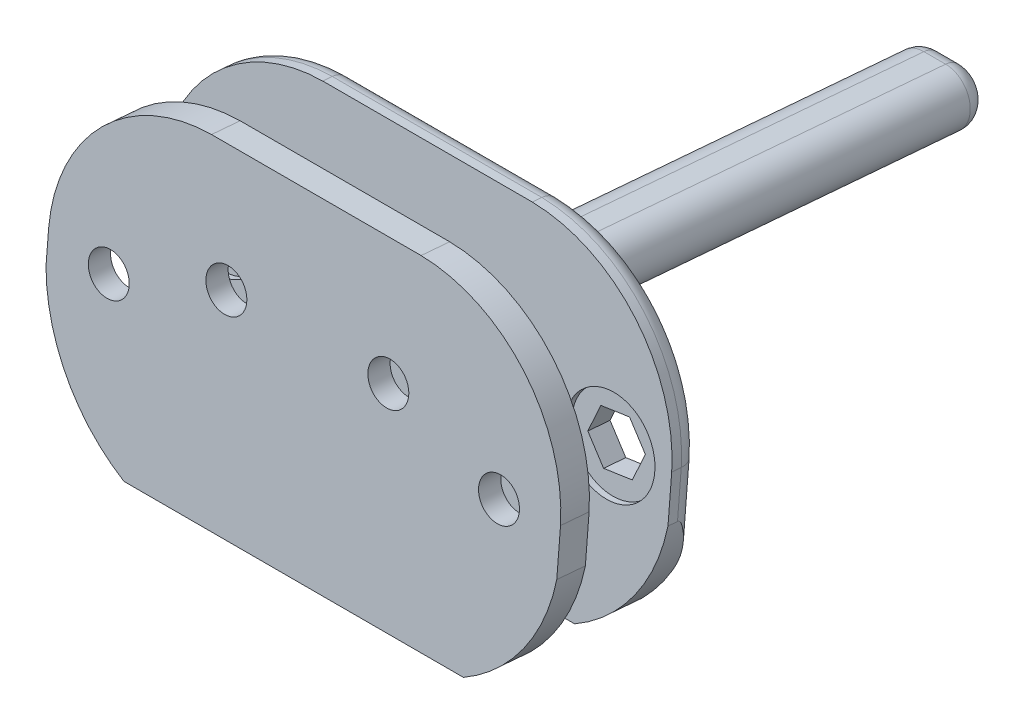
ISO-10303-21;
HEADER;
FILE_DESCRIPTION(('STEP AP214'),'2;1');
FILE_NAME('part.step','',(''),(''),'','','');
FILE_SCHEMA(('AUTOMOTIVE_DESIGN { 1 0 10303 214 1 1 1 1 }'));
ENDSEC;
DATA;
#1=APPLICATION_CONTEXT('core data for automotive mechanical design processes');
#2=APPLICATION_PROTOCOL_DEFINITION('international standard','automotive_design',2000,#1);
#3=PRODUCT_CONTEXT('',#1,'mechanical');
#4=PRODUCT('Part','Part','',(#3));
#5=PRODUCT_RELATED_PRODUCT_CATEGORY('part','',(#4));
#6=PRODUCT_DEFINITION_FORMATION('','',#4);
#7=PRODUCT_DEFINITION_CONTEXT('part definition',#1,'design');
#8=PRODUCT_DEFINITION('design','',#6,#7);
#9=PRODUCT_DEFINITION_SHAPE('','',#8);
#10=(LENGTH_UNIT() NAMED_UNIT(*) SI_UNIT(.MILLI.,.METRE.));
#11=(NAMED_UNIT(*) PLANE_ANGLE_UNIT() SI_UNIT($,.RADIAN.));
#12=(NAMED_UNIT(*) SI_UNIT($,.STERADIAN.) SOLID_ANGLE_UNIT());
#13=UNCERTAINTY_MEASURE_WITH_UNIT(LENGTH_MEASURE(1.E-05),#10,'distance_accuracy_value','');
#14=(GEOMETRIC_REPRESENTATION_CONTEXT(3) GLOBAL_UNCERTAINTY_ASSIGNED_CONTEXT((#13)) GLOBAL_UNIT_ASSIGNED_CONTEXT((#10,
#11,#12)) REPRESENTATION_CONTEXT('',''));
#15=CARTESIAN_POINT('',(0.,0.,0.));
#16=DIRECTION('',(0.,0.,1.));
#17=DIRECTION('',(1.,0.,0.));
#18=AXIS2_PLACEMENT_3D('',#15,#16,#17);
#19=CARTESIAN_POINT('',(73.7136594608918,-23.7263383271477,-111.92817200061));
#20=DIRECTION('',(0.,0.08304547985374,0.99654575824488));
#21=DIRECTION('',(0.,-0.99654575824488,0.08304547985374));
#22=AXIS2_PLACEMENT_3D('',#19,#20,#21);
#23=CYLINDRICAL_SURFACE('',#22,4.20130742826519);
#24=DIRECTION('',(0.,0.08304547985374,0.99654575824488));
#25=VECTOR('',#24,1.);
#26=CARTESIAN_POINT('',(73.7136594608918,-27.9131334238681,-111.579272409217));
#27=LINE('',#26,#25);
#28=CARTESIAN_POINT('',(73.7136594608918,-27.6639969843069,-108.589635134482));
#29=VERTEX_POINT('',#28);
#30=CARTESIAN_POINT('',(73.7136594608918,-21.2694950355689,-31.8556117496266));
#31=VERTEX_POINT('',#30);
#32=EDGE_CURVE('E108',#29,#31,#27,.T.);
#33=ORIENTED_EDGE('',*,*,#32,.F.);
#34=CARTESIAN_POINT('',(73.7136594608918,-23.4772018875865,-108.938534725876));
#35=DIRECTION('',(0.,-0.08304547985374,-0.99654575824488));
#36=DIRECTION('',(0.,0.99654575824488,-0.08304547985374));
#37=AXIS2_PLACEMENT_3D('',#34,#35,#36);
#38=CIRCLE('',#37,4.20130742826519);
#39=CARTESIAN_POINT('',(73.7136594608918,-19.2904067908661,-109.287434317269));
#40=VERTEX_POINT('',#39);
#41=EDGE_CURVE('E65',#29,#40,#38,.F.);
#42=ORIENTED_EDGE('',*,*,#41,.T.);
#43=DIRECTION('',(0.,0.08304547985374,0.99654575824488));
#44=VECTOR('',#43,1.);
#45=CARTESIAN_POINT('',(73.7136594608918,-19.5395432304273,-112.277071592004));
#46=LINE('',#45,#44);
#47=CARTESIAN_POINT('',(73.7136594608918,-12.8959048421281,-32.5534109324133));
#48=VERTEX_POINT('',#47);
#49=EDGE_CURVE('E125',#40,#48,#46,.T.);
#50=ORIENTED_EDGE('',*,*,#49,.T.);
#51=CARTESIAN_POINT('',(73.7136594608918,-17.0826999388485,-32.20451134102));
#52=DIRECTION('',(0.,-0.08304547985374,-0.99654575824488));
#53=DIRECTION('',(0.,0.99654575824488,-0.08304547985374));
#54=AXIS2_PLACEMENT_3D('',#51,#52,#53);
#55=CIRCLE('',#54,4.20130742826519);
#56=EDGE_CURVE('E121',#48,#31,#55,.T.);
#57=ORIENTED_EDGE('',*,*,#56,.T.);
#58=EDGE_LOOP('',(#33,#42,#50,#57));
#59=FACE_BOUND('',#58,.T.);
#60=ADVANCED_FACE('F56',(#59),#23,.T.);
#61=CARTESIAN_POINT('',(73.7136594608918,-27.9131334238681,-111.579272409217));
#62=DIRECTION('',(0.,0.99654575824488,-0.08304547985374));
#63=DIRECTION('',(0.,0.08304547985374,0.99654575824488));
#64=AXIS2_PLACEMENT_3D('',#61,#62,#63);
#65=PLANE('',#64);
#66=DIRECTION('',(0.,0.08304547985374,0.99654575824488));
#67=VECTOR('',#66,1.);
#68=CARTESIAN_POINT('',(70.3136594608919,-27.9131334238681,-111.579272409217));
#69=LINE('',#68,#67);
#70=CARTESIAN_POINT('',(70.3136594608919,-27.6639969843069,-108.589635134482));
#71=VERTEX_POINT('',#70);
#72=CARTESIAN_POINT('',(70.3136594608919,-21.2694950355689,-31.8556117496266));
#73=VERTEX_POINT('',#72);
#74=EDGE_CURVE('E115',#71,#73,#69,.T.);
#75=ORIENTED_EDGE('',*,*,#74,.F.);
#76=DIRECTION('',(-1.,0.,0.));
#77=VECTOR('',#76,1.);
#78=CARTESIAN_POINT('',(73.7136594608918,-27.6639969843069,-108.589635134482));
#79=LINE('',#78,#77);
#80=EDGE_CURVE('E80',#71,#29,#79,.F.);
#81=ORIENTED_EDGE('',*,*,#80,.T.);
#82=ORIENTED_EDGE('',*,*,#32,.T.);
#83=DIRECTION('',(-1.,0.,0.));
#84=VECTOR('',#83,1.);
#85=CARTESIAN_POINT('',(73.7136594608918,-21.2694950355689,-31.8556117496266));
#86=LINE('',#85,#84);
#87=EDGE_CURVE('E111',#31,#73,#86,.T.);
#88=ORIENTED_EDGE('',*,*,#87,.T.);
#89=EDGE_LOOP('',(#75,#81,#82,#88));
#90=FACE_BOUND('',#89,.T.);
#91=ADVANCED_FACE('F110',(#90),#65,.F.);
#92=CARTESIAN_POINT('',(70.3136594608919,-23.7263383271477,-111.92817200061));
#93=DIRECTION('',(0.,0.08304547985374,0.99654575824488));
#94=DIRECTION('',(0.,-0.99654575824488,0.08304547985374));
#95=AXIS2_PLACEMENT_3D('',#92,#93,#94);
#96=CYLINDRICAL_SURFACE('',#95,4.20130742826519);
#97=DIRECTION('',(0.,0.08304547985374,0.99654575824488));
#98=VECTOR('',#97,1.);
#99=CARTESIAN_POINT('',(70.3136594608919,-19.5395432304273,-112.277071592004));
#100=LINE('',#99,#98);
#101=CARTESIAN_POINT('',(70.3136594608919,-19.2904067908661,-109.287434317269));
#102=VERTEX_POINT('',#101);
#103=CARTESIAN_POINT('',(70.3136594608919,-12.8959048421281,-32.5534109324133));
#104=VERTEX_POINT('',#103);
#105=EDGE_CURVE('E135',#102,#104,#100,.T.);
#106=ORIENTED_EDGE('',*,*,#105,.F.);
#107=CARTESIAN_POINT('',(70.3136594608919,-23.4772018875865,-108.938534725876));
#108=DIRECTION('',(0.,-0.08304547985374,-0.99654575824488));
#109=DIRECTION('',(0.,0.99654575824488,-0.08304547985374));
#110=AXIS2_PLACEMENT_3D('',#107,#108,#109);
#111=CIRCLE('',#110,4.20130742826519);
#112=EDGE_CURVE('E146',#102,#71,#111,.F.);
#113=ORIENTED_EDGE('',*,*,#112,.T.);
#114=ORIENTED_EDGE('',*,*,#74,.T.);
#115=CARTESIAN_POINT('',(70.3136594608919,-17.0826999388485,-32.20451134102));
#116=DIRECTION('',(0.,-0.08304547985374,-0.99654575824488));
#117=DIRECTION('',(0.,0.99654575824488,-0.08304547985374));
#118=AXIS2_PLACEMENT_3D('',#115,#116,#117);
#119=CIRCLE('',#118,4.20130742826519);
#120=EDGE_CURVE('E123',#73,#104,#119,.T.);
#121=ORIENTED_EDGE('',*,*,#120,.T.);
#122=EDGE_LOOP('',(#106,#113,#114,#121));
#123=FACE_BOUND('',#122,.T.);
#124=ADVANCED_FACE('F174',(#123),#96,.T.);
#125=CARTESIAN_POINT('',(73.7136594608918,-19.5395432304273,-112.277071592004));
#126=DIRECTION('',(0.,-0.99654575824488,0.08304547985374));
#127=DIRECTION('',(0.,-0.08304547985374,-0.99654575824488));
#128=AXIS2_PLACEMENT_3D('',#125,#126,#127);
#129=PLANE('',#128);
#130=ORIENTED_EDGE('',*,*,#49,.F.);
#131=DIRECTION('',(1.,0.,0.));
#132=VECTOR('',#131,1.);
#133=CARTESIAN_POINT('',(70.3136594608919,-19.2904067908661,-109.287434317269));
#134=LINE('',#133,#132);
#135=EDGE_CURVE('E12',#40,#102,#134,.F.);
#136=ORIENTED_EDGE('',*,*,#135,.T.);
#137=ORIENTED_EDGE('',*,*,#105,.T.);
#138=DIRECTION('',(1.,0.,0.));
#139=VECTOR('',#138,1.);
#140=CARTESIAN_POINT('',(73.7136594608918,-12.8959048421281,-32.5534109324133));
#141=LINE('',#140,#139);
#142=EDGE_CURVE('E132',#104,#48,#141,.T.);
#143=ORIENTED_EDGE('',*,*,#142,.T.);
#144=EDGE_LOOP('',(#130,#136,#137,#143));
#145=FACE_BOUND('',#144,.T.);
#146=ADVANCED_FACE('F176',(#145),#129,.F.);
#147=CARTESIAN_POINT('',(73.7136594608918,-23.7263383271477,-111.92817200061));
#148=DIRECTION('',(0.,-0.08304547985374,-0.99654575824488));
#149=DIRECTION('',(0.,0.99654575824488,-0.08304547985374));
#150=AXIS2_PLACEMENT_3D('',#147,#148,#149);
#151=PLANE('',#150);
#152=DIRECTION('',(-1.,0.,0.));
#153=VECTOR('',#152,1.);
#154=CARTESIAN_POINT('',(70.3136594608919,-24.9234961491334,-111.828408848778));
#155=LINE('',#154,#153);
#156=CARTESIAN_POINT('',(73.7136594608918,-24.9234961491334,-111.828408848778));
#157=VERTEX_POINT('',#156);
#158=CARTESIAN_POINT('',(70.3136594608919,-24.9234961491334,-111.828408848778));
#159=VERTEX_POINT('',#158);
#160=EDGE_CURVE('E141',#157,#159,#155,.T.);
#161=ORIENTED_EDGE('',*,*,#160,.T.);
#162=CARTESIAN_POINT('',(70.3136594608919,-23.7263383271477,-111.92817200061));
#163=DIRECTION('',(0.,-0.08304547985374,-0.99654575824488));
#164=DIRECTION('',(0.,0.99654575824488,-0.08304547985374));
#165=AXIS2_PLACEMENT_3D('',#162,#163,#164);
#166=CIRCLE('',#165,1.20130742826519);
#167=CARTESIAN_POINT('',(70.3136594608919,-22.529180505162,-112.027935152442));
#168=VERTEX_POINT('',#167);
#169=EDGE_CURVE('E143',#159,#168,#166,.T.);
#170=ORIENTED_EDGE('',*,*,#169,.T.);
#171=DIRECTION('',(1.,0.,0.));
#172=VECTOR('',#171,1.);
#173=CARTESIAN_POINT('',(73.7136594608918,-22.529180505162,-112.027935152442));
#174=LINE('',#173,#172);
#175=CARTESIAN_POINT('',(73.7136594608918,-22.529180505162,-112.027935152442));
#176=VERTEX_POINT('',#175);
#177=EDGE_CURVE('E114',#168,#176,#174,.T.);
#178=ORIENTED_EDGE('',*,*,#177,.T.);
#179=CARTESIAN_POINT('',(73.7136594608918,-23.7263383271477,-111.92817200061));
#180=DIRECTION('',(0.,-0.08304547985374,-0.99654575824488));
#181=DIRECTION('',(0.,0.99654575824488,-0.08304547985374));
#182=AXIS2_PLACEMENT_3D('',#179,#180,#181);
#183=CIRCLE('',#182,1.20130742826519);
#184=EDGE_CURVE('E139',#176,#157,#183,.T.);
#185=ORIENTED_EDGE('',*,*,#184,.T.);
#186=EDGE_LOOP('',(#161,#170,#178,#185));
#187=FACE_BOUND('',#186,.T.);
#188=ADVANCED_FACE('F166',(#187),#151,.T.);
#189=CARTESIAN_POINT('',(73.7136594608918,-17.0826999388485,-32.20451134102));
#190=DIRECTION('',(0.,-0.08304547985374,-0.99654575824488));
#191=DIRECTION('',(0.,0.99654575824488,-0.08304547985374));
#192=AXIS2_PLACEMENT_3D('',#189,#190,#191);
#193=PLANE('',#192);
#194=ORIENTED_EDGE('',*,*,#56,.F.);
#195=ORIENTED_EDGE('',*,*,#142,.F.);
#196=ORIENTED_EDGE('',*,*,#120,.F.);
#197=ORIENTED_EDGE('',*,*,#87,.F.);
#198=EDGE_LOOP('',(#194,#195,#196,#197));
#199=FACE_BOUND('',#198,.T.);
#200=ADVANCED_FACE('F119',(#199),#193,.F.);
#201=CARTESIAN_POINT('',(73.7136594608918,-23.4772018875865,-108.938534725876));
#202=DIRECTION('',(0.,-0.08304547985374,-0.99654575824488));
#203=DIRECTION('',(0.,0.99654575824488,-0.08304547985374));
#204=AXIS2_PLACEMENT_3D('',#201,#202,#203);
#205=DEGENERATE_TOROIDAL_SURFACE('',#204,1.20130742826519,3.,.T.);
#206=CARTESIAN_POINT('',(73.7136594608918,-22.2800440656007,-109.038297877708));
#207=DIRECTION('',(-1.,0.,0.));
#208=DIRECTION('',(0.,0.,1.));
#209=AXIS2_PLACEMENT_3D('',#206,#207,#208);
#210=CIRCLE('',#209,3.);
#211=EDGE_CURVE('E129',#40,#176,#210,.T.);
#212=ORIENTED_EDGE('',*,*,#211,.F.);
#213=ORIENTED_EDGE('',*,*,#41,.F.);
#214=CARTESIAN_POINT('',(73.7136594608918,-24.6743597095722,-108.838771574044));
#215=DIRECTION('',(-1.,0.,0.));
#216=DIRECTION('',(0.,0.,1.));
#217=AXIS2_PLACEMENT_3D('',#214,#215,#216);
#218=CIRCLE('',#217,3.);
#219=EDGE_CURVE('E60',#157,#29,#218,.T.);
#220=ORIENTED_EDGE('',*,*,#219,.F.);
#221=ORIENTED_EDGE('',*,*,#184,.F.);
#222=EDGE_LOOP('',(#212,#213,#220,#221));
#223=FACE_BOUND('',#222,.T.);
#224=ADVANCED_FACE('F58',(#223),#205,.T.);
#225=CARTESIAN_POINT('',(73.7136594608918,-24.6743597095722,-108.838771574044));
#226=DIRECTION('',(1.,0.,0.));
#227=DIRECTION('',(0.,0.,-1.));
#228=AXIS2_PLACEMENT_3D('',#225,#226,#227);
#229=CYLINDRICAL_SURFACE('',#228,3.);
#230=ORIENTED_EDGE('',*,*,#219,.T.);
#231=ORIENTED_EDGE('',*,*,#80,.F.);
#232=CARTESIAN_POINT('',(70.3136594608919,-24.6743597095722,-108.838771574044));
#233=DIRECTION('',(-1.,0.,0.));
#234=DIRECTION('',(0.,0.,1.));
#235=AXIS2_PLACEMENT_3D('',#232,#233,#234);
#236=CIRCLE('',#235,3.);
#237=EDGE_CURVE('E153',#159,#71,#236,.T.);
#238=ORIENTED_EDGE('',*,*,#237,.F.);
#239=ORIENTED_EDGE('',*,*,#160,.F.);
#240=EDGE_LOOP('',(#230,#231,#238,#239));
#241=FACE_BOUND('',#240,.T.);
#242=ADVANCED_FACE('F196',(#241),#229,.T.);
#243=CARTESIAN_POINT('',(73.7136594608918,-22.2800440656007,-109.038297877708));
#244=DIRECTION('',(-1.,0.,0.));
#245=DIRECTION('',(0.,0.,1.));
#246=AXIS2_PLACEMENT_3D('',#243,#244,#245);
#247=CYLINDRICAL_SURFACE('',#246,3.);
#248=ORIENTED_EDGE('',*,*,#211,.T.);
#249=ORIENTED_EDGE('',*,*,#177,.F.);
#250=CARTESIAN_POINT('',(70.3136594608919,-22.2800440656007,-109.038297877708));
#251=DIRECTION('',(-1.,0.,0.));
#252=DIRECTION('',(0.,0.,1.));
#253=AXIS2_PLACEMENT_3D('',#250,#251,#252);
#254=CIRCLE('',#253,3.);
#255=EDGE_CURVE('E151',#102,#168,#254,.T.);
#256=ORIENTED_EDGE('',*,*,#255,.F.);
#257=ORIENTED_EDGE('',*,*,#135,.F.);
#258=EDGE_LOOP('',(#248,#249,#256,#257));
#259=FACE_BOUND('',#258,.T.);
#260=ADVANCED_FACE('F159',(#259),#247,.T.);
#261=CARTESIAN_POINT('',(70.3136594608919,-23.4772018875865,-108.938534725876));
#262=DIRECTION('',(0.,-0.08304547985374,-0.99654575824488));
#263=DIRECTION('',(0.,0.99654575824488,-0.08304547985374));
#264=AXIS2_PLACEMENT_3D('',#261,#262,#263);
#265=DEGENERATE_TOROIDAL_SURFACE('',#264,1.20130742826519,3.,.T.);
#266=ORIENTED_EDGE('',*,*,#237,.T.);
#267=ORIENTED_EDGE('',*,*,#112,.F.);
#268=ORIENTED_EDGE('',*,*,#255,.T.);
#269=ORIENTED_EDGE('',*,*,#169,.F.);
#270=EDGE_LOOP('',(#266,#267,#268,#269));
#271=FACE_BOUND('',#270,.T.);
#272=ADVANCED_FACE('F170',(#271),#265,.T.);
#273=CLOSED_SHELL('',(#60,#91,#124,#146,#188,#200,#224,#242,#260,#272));
#274=MANIFOLD_SOLID_BREP('B2',#273);
#275=CARTESIAN_POINT('',(105.382665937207,-19.489527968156,-27.9900774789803));
#276=DIRECTION('',(0.138762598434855,-0.986904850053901,0.0822420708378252));
#277=DIRECTION('',(0.990259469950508,0.139234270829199,0.));
#278=AXIS2_PLACEMENT_3D('',#275,#276,#277);
#279=PLANE('',#278);
#280=DIRECTION('',(-0.990325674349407,-0.138283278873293,0.0115236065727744));
#281=VECTOR('',#280,1.);
#282=CARTESIAN_POINT('',(105.382665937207,-19.5310507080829,-28.4883503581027));
#283=LINE('',#282,#281);
#284=CARTESIAN_POINT('',(105.382665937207,-19.5310507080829,-28.4883503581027));
#285=VERTEX_POINT('',#284);
#286=CARTESIAN_POINT('',(100.926200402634,-20.1533254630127,-28.4364941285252));
#287=VERTEX_POINT('',#286);
#288=EDGE_CURVE('E670',#285,#287,#283,.T.);
#289=ORIENTED_EDGE('',*,*,#288,.F.);
#290=DIRECTION('',(0.,-0.08304547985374,-0.99654575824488));
#291=VECTOR('',#290,1.);
#292=CARTESIAN_POINT('',(105.382665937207,-19.489527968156,-27.9900774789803));
#293=LINE('',#292,#291);
#294=CARTESIAN_POINT('',(105.382665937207,-19.821709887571,-31.9762605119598));
#295=VERTEX_POINT('',#294);
#296=EDGE_CURVE('E699',#285,#295,#293,.T.);
#297=ORIENTED_EDGE('',*,*,#296,.T.);
#298=DIRECTION('',(-0.990325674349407,-0.138283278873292,0.0115236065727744));
#299=VECTOR('',#298,1.);
#300=CARTESIAN_POINT('',(105.382665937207,-19.821709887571,-31.9762605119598));
#301=LINE('',#300,#299);
#302=CARTESIAN_POINT('',(100.926200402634,-20.4439846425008,-31.9244042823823));
#303=VERTEX_POINT('',#302);
#304=EDGE_CURVE('E696',#295,#303,#301,.T.);
#305=ORIENTED_EDGE('',*,*,#304,.T.);
#306=DIRECTION('',(0.,-0.08304547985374,-0.99654575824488));
#307=VECTOR('',#306,1.);
#308=CARTESIAN_POINT('',(100.926200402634,-20.1118027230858,-27.9382212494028));
#309=LINE('',#308,#307);
#310=EDGE_CURVE('E504',#287,#303,#309,.T.);
#311=ORIENTED_EDGE('',*,*,#310,.F.);
#312=EDGE_LOOP('',(#289,#297,#305,#311));
#313=FACE_BOUND('',#312,.T.);
#314=ADVANCED_FACE('F289',(#313),#279,.F.);
#315=CARTESIAN_POINT('',(107.070124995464,-15.3323095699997,-28.3365123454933));
#316=DIRECTION('',(0.927028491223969,-0.373695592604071,0.0311412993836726));
#317=DIRECTION('',(0.373876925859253,0.927478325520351,0.));
#318=AXIS2_PLACEMENT_3D('',#315,#316,#317);
#319=PLANE('',#318);
#320=DIRECTION('',(-0.37499090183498,-0.923826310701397,0.0769855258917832));
#321=VECTOR('',#320,1.);
#322=CARTESIAN_POINT('',(107.070124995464,-15.3738323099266,-28.8347852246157));
#323=LINE('',#322,#321);
#324=CARTESIAN_POINT('',(107.070124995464,-15.3738323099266,-28.8347852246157));
#325=VERTEX_POINT('',#324);
#326=EDGE_CURVE('E754',#325,#285,#323,.T.);
#327=ORIENTED_EDGE('',*,*,#326,.F.);
#328=DIRECTION('',(0.,-0.08304547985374,-0.99654575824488));
#329=VECTOR('',#328,1.);
#330=CARTESIAN_POINT('',(107.070124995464,-15.3323095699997,-28.3365123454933));
#331=LINE('',#330,#329);
#332=CARTESIAN_POINT('',(107.070124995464,-15.6644914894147,-32.3226953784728));
#333=VERTEX_POINT('',#332);
#334=EDGE_CURVE('E716',#325,#333,#331,.T.);
#335=ORIENTED_EDGE('',*,*,#334,.T.);
#336=DIRECTION('',(-0.37499090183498,-0.923826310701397,0.0769855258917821));
#337=VECTOR('',#336,1.);
#338=CARTESIAN_POINT('',(107.070124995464,-15.6644914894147,-32.3226953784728));
#339=LINE('',#338,#337);
#340=EDGE_CURVE('E717',#333,#295,#339,.T.);
#341=ORIENTED_EDGE('',*,*,#340,.T.);
#342=ORIENTED_EDGE('',*,*,#296,.F.);
#343=EDGE_LOOP('',(#327,#335,#341,#342));
#344=FACE_BOUND('',#343,.T.);
#345=ADVANCED_FACE('F604',(#344),#319,.F.);
#346=CARTESIAN_POINT('',(104.301118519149,-11.7973659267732,-28.6310909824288));
#347=DIRECTION('',(0.788265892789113,0.613209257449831,-0.0511007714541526));
#348=DIRECTION('',(-0.614011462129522,0.789297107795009,0.));
#349=AXIS2_PLACEMENT_3D('',#346,#347,#348);
#350=PLANE('',#349);
#351=DIRECTION('',(0.615334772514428,-0.785543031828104,0.0654619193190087));
#352=VECTOR('',#351,1.);
#353=CARTESIAN_POINT('',(104.301118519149,-11.8388886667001,-29.1293638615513));
#354=LINE('',#353,#352);
#355=CARTESIAN_POINT('',(104.301118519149,-11.8388886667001,-29.1293638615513));
#356=VERTEX_POINT('',#355);
#357=EDGE_CURVE('E747',#356,#325,#354,.T.);
#358=ORIENTED_EDGE('',*,*,#357,.F.);
#359=DIRECTION('',(0.,-0.08304547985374,-0.99654575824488));
#360=VECTOR('',#359,1.);
#361=CARTESIAN_POINT('',(104.301118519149,-11.7973659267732,-28.6310909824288));
#362=LINE('',#361,#360);
#363=CARTESIAN_POINT('',(104.301118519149,-12.1295478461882,-32.6172740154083));
#364=VERTEX_POINT('',#363);
#365=EDGE_CURVE('E712',#356,#364,#362,.T.);
#366=ORIENTED_EDGE('',*,*,#365,.T.);
#367=DIRECTION('',(0.615334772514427,-0.785543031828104,0.0654619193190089));
#368=VECTOR('',#367,1.);
#369=CARTESIAN_POINT('',(104.301118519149,-12.1295478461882,-32.6172740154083));
#370=LINE('',#369,#368);
#371=EDGE_CURVE('E713',#364,#333,#370,.T.);
#372=ORIENTED_EDGE('',*,*,#371,.T.);
#373=ORIENTED_EDGE('',*,*,#334,.F.);
#374=EDGE_LOOP('',(#358,#366,#372,#373));
#375=FACE_BOUND('',#374,.T.);
#376=ADVANCED_FACE('F610',(#375),#350,.F.);
#377=CARTESIAN_POINT('',(99.844652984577,-12.419640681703,-28.5792347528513));
#378=DIRECTION('',(-0.138762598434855,0.986904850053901,-0.0822420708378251));
#379=DIRECTION('',(-0.990259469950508,-0.139234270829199,0.));
#380=AXIS2_PLACEMENT_3D('',#377,#378,#379);
#381=PLANE('',#380);
#382=DIRECTION('',(0.990325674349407,0.138283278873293,-0.0115236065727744));
#383=VECTOR('',#382,1.);
#384=CARTESIAN_POINT('',(99.844652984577,-12.4611634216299,-29.0775076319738));
#385=LINE('',#384,#383);
#386=CARTESIAN_POINT('',(99.844652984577,-12.4611634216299,-29.0775076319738));
#387=VERTEX_POINT('',#386);
#388=EDGE_CURVE('E745',#387,#356,#385,.T.);
#389=ORIENTED_EDGE('',*,*,#388,.F.);
#390=DIRECTION('',(0.,-0.08304547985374,-0.99654575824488));
#391=VECTOR('',#390,1.);
#392=CARTESIAN_POINT('',(99.844652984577,-12.419640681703,-28.5792347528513));
#393=LINE('',#392,#391);
#394=CARTESIAN_POINT('',(99.844652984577,-12.751822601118,-32.5654177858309));
#395=VERTEX_POINT('',#394);
#396=EDGE_CURVE('E708',#387,#395,#393,.T.);
#397=ORIENTED_EDGE('',*,*,#396,.T.);
#398=DIRECTION('',(0.990325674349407,0.138283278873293,-0.0115236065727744));
#399=VECTOR('',#398,1.);
#400=CARTESIAN_POINT('',(99.844652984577,-12.751822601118,-32.5654177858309));
#401=LINE('',#400,#399);
#402=EDGE_CURVE('E709',#395,#364,#401,.T.);
#403=ORIENTED_EDGE('',*,*,#402,.T.);
#404=ORIENTED_EDGE('',*,*,#365,.F.);
#405=EDGE_LOOP('',(#389,#397,#403,#404));
#406=FACE_BOUND('',#405,.T.);
#407=ADVANCED_FACE('F839',(#406),#381,.F.);
#408=CARTESIAN_POINT('',(98.1571939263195,-16.5768590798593,-28.2327998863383));
#409=DIRECTION('',(-0.927028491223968,0.373695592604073,-0.0311412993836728));
#410=DIRECTION('',(-0.373876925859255,-0.927478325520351,0.));
#411=AXIS2_PLACEMENT_3D('',#408,#409,#410);
#412=PLANE('',#411);
#413=DIRECTION('',(0.374990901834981,0.923826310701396,-0.0769855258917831));
#414=VECTOR('',#413,1.);
#415=CARTESIAN_POINT('',(98.1571939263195,-16.6183818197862,-28.7310727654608));
#416=LINE('',#415,#414);
#417=CARTESIAN_POINT('',(98.1571939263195,-16.6183818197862,-28.7310727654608));
#418=VERTEX_POINT('',#417);
#419=EDGE_CURVE('E742',#418,#387,#416,.T.);
#420=ORIENTED_EDGE('',*,*,#419,.F.);
#421=DIRECTION('',(0.,-0.08304547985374,-0.99654575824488));
#422=VECTOR('',#421,1.);
#423=CARTESIAN_POINT('',(98.1571939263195,-16.5768590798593,-28.2327998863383));
#424=LINE('',#423,#422);
#425=CARTESIAN_POINT('',(98.1571939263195,-16.9090409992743,-32.2189829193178));
#426=VERTEX_POINT('',#425);
#427=EDGE_CURVE('E704',#418,#426,#424,.T.);
#428=ORIENTED_EDGE('',*,*,#427,.T.);
#429=DIRECTION('',(0.374990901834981,0.923826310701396,-0.0769855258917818));
#430=VECTOR('',#429,1.);
#431=CARTESIAN_POINT('',(98.1571939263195,-16.9090409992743,-32.2189829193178));
#432=LINE('',#431,#430);
#433=EDGE_CURVE('E705',#426,#395,#432,.T.);
#434=ORIENTED_EDGE('',*,*,#433,.T.);
#435=ORIENTED_EDGE('',*,*,#396,.F.);
#436=EDGE_LOOP('',(#420,#428,#434,#435));
#437=FACE_BOUND('',#436,.T.);
#438=ADVANCED_FACE('F741',(#437),#412,.F.);
#439=CARTESIAN_POINT('',(100.926200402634,-20.1118027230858,-27.9382212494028));
#440=DIRECTION('',(-0.788265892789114,-0.61320925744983,0.0511007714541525));
#441=DIRECTION('',(0.614011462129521,-0.78929710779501,0.));
#442=AXIS2_PLACEMENT_3D('',#439,#440,#441);
#443=PLANE('',#442);
#444=DIRECTION('',(-0.615334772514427,0.785543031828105,-0.0654619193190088));
#445=VECTOR('',#444,1.);
#446=CARTESIAN_POINT('',(100.926200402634,-20.1533254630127,-28.4364941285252));
#447=LINE('',#446,#445);
#448=EDGE_CURVE('E461',#287,#418,#447,.T.);
#449=ORIENTED_EDGE('',*,*,#448,.F.);
#450=ORIENTED_EDGE('',*,*,#310,.T.);
#451=DIRECTION('',(-0.615334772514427,0.785543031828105,-0.0654619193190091));
#452=VECTOR('',#451,1.);
#453=CARTESIAN_POINT('',(100.926200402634,-20.4439846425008,-31.9244042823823));
#454=LINE('',#453,#452);
#455=EDGE_CURVE('E701',#303,#426,#454,.T.);
#456=ORIENTED_EDGE('',*,*,#455,.T.);
#457=ORIENTED_EDGE('',*,*,#427,.F.);
#458=EDGE_LOOP('',(#449,#450,#456,#457));
#459=FACE_BOUND('',#458,.T.);
#460=ADVANCED_FACE('F616',(#459),#443,.F.);
#461=CARTESIAN_POINT('',(44.1069349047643,-19.5471652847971,-27.9852743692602));
#462=DIRECTION('',(0.117761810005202,-0.989611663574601,0.0824676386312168));
#463=DIRECTION('',(0.992994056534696,0.118164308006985,0.));
#464=AXIS2_PLACEMENT_3D('',#461,#462,#463);
#465=PLANE('',#464);
#466=DIRECTION('',(-0.993041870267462,-0.117355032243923,0.00977958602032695));
#467=VECTOR('',#466,1.);
#468=CARTESIAN_POINT('',(44.1069349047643,-19.588688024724,-28.4835472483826));
#469=LINE('',#468,#467);
#470=CARTESIAN_POINT('',(44.1069349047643,-19.588688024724,-28.4835472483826));
#471=VERTEX_POINT('',#470);
#472=CARTESIAN_POINT('',(39.6382464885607,-20.1167856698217,-28.4395391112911));
#473=VERTEX_POINT('',#472);
#474=EDGE_CURVE('E457',#471,#473,#469,.T.);
#475=ORIENTED_EDGE('',*,*,#474,.F.);
#476=DIRECTION('',(0.,-0.08304547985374,-0.99654575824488));
#477=VECTOR('',#476,1.);
#478=CARTESIAN_POINT('',(44.1069349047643,-19.5471652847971,-27.9852743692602));
#479=LINE('',#478,#477);
#480=CARTESIAN_POINT('',(44.1069349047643,-19.8793472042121,-31.9714574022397));
#481=VERTEX_POINT('',#480);
#482=EDGE_CURVE('E493',#471,#481,#479,.T.);
#483=ORIENTED_EDGE('',*,*,#482,.T.);
#484=DIRECTION('',(-0.993041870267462,-0.117355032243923,0.00977958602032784));
#485=VECTOR('',#484,1.);
#486=CARTESIAN_POINT('',(44.1069349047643,-19.8793472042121,-31.9714574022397));
#487=LINE('',#486,#485);
#488=CARTESIAN_POINT('',(39.6382464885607,-20.4074448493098,-31.9274492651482));
#489=VERTEX_POINT('',#488);
#490=EDGE_CURVE('E495',#481,#489,#487,.T.);
#491=ORIENTED_EDGE('',*,*,#490,.T.);
#492=DIRECTION('',(0.,-0.08304547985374,-0.99654575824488));
#493=VECTOR('',#492,1.);
#494=CARTESIAN_POINT('',(39.6382464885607,-20.0752629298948,-27.9412662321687));
#495=LINE('',#494,#493);
#496=EDGE_CURVE('E462',#473,#489,#495,.T.);
#497=ORIENTED_EDGE('',*,*,#496,.F.);
#498=EDGE_LOOP('',(#475,#483,#491,#497));
#499=FACE_BOUND('',#498,.T.);
#500=ADVANCED_FACE('F618',(#499),#465,.F.);
#501=CARTESIAN_POINT('',(45.8823478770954,-15.4264866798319,-28.3286642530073));
#502=DIRECTION('',(0.918880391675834,-0.393173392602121,0.0327644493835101));
#503=DIRECTION('',(0.393384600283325,0.919374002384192,0.));
#504=AXIS2_PLACEMENT_3D('',#501,#502,#503);
#505=PLANE('',#504);
#506=DIRECTION('',(-0.394536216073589,-0.915706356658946,0.0763088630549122));
#507=VECTOR('',#506,1.);
#508=CARTESIAN_POINT('',(45.8823478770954,-15.4680094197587,-28.8269371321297));
#509=LINE('',#508,#507);
#510=CARTESIAN_POINT('',(45.8823478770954,-15.4680094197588,-28.8269371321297));
#511=VERTEX_POINT('',#510);
#512=EDGE_CURVE('E749',#511,#471,#509,.T.);
#513=ORIENTED_EDGE('',*,*,#512,.F.);
#514=DIRECTION('',(0.,-0.08304547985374,-0.99654575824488));
#515=VECTOR('',#514,1.);
#516=CARTESIAN_POINT('',(45.8823478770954,-15.4264866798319,-28.3286642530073));
#517=LINE('',#516,#515);
#518=CARTESIAN_POINT('',(45.8823478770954,-15.7586685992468,-32.3148472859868));
#519=VERTEX_POINT('',#518);
#520=EDGE_CURVE('E490',#511,#519,#517,.T.);
#521=ORIENTED_EDGE('',*,*,#520,.T.);
#522=DIRECTION('',(-0.394536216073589,-0.915706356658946,0.0763088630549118));
#523=VECTOR('',#522,1.);
#524=CARTESIAN_POINT('',(45.8823478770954,-15.7586685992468,-32.3148472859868));
#525=LINE('',#524,#523);
#526=EDGE_CURVE('E492',#519,#481,#525,.T.);
#527=ORIENTED_EDGE('',*,*,#526,.T.);
#528=ORIENTED_EDGE('',*,*,#482,.F.);
#529=EDGE_LOOP('',(#513,#521,#527,#528));
#530=FACE_BOUND('',#529,.T.);
#531=ADVANCED_FACE('F621',(#530),#505,.F.);
#532=CARTESIAN_POINT('',(43.189072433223,-11.8339057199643,-28.6280459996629));
#533=DIRECTION('',(0.801118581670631,0.596438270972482,-0.0497031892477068));
#534=DIRECTION('',(-0.597176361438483,0.802109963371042,0.));
#535=AXIS2_PLACEMENT_3D('',#532,#533,#534);
#536=PLANE('',#535);
#537=DIRECTION('',(0.598505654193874,-0.798351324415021,0.0665292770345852));
#538=VECTOR('',#537,1.);
#539=CARTESIAN_POINT('',(43.189072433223,-11.8754284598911,-29.1263188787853));
#540=LINE('',#539,#538);
#541=CARTESIAN_POINT('',(43.189072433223,-11.8754284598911,-29.1263188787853));
#542=VERTEX_POINT('',#541);
#543=EDGE_CURVE('E811',#542,#511,#540,.T.);
#544=ORIENTED_EDGE('',*,*,#543,.F.);
#545=DIRECTION('',(0.,-0.08304547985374,-0.99654575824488));
#546=VECTOR('',#545,1.);
#547=CARTESIAN_POINT('',(43.189072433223,-11.8339057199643,-28.6280459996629));
#548=LINE('',#547,#546);
#549=CARTESIAN_POINT('',(43.189072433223,-12.1660876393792,-32.6142290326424));
#550=VERTEX_POINT('',#549);
#551=EDGE_CURVE('E487',#542,#550,#548,.T.);
#552=ORIENTED_EDGE('',*,*,#551,.T.);
#553=DIRECTION('',(0.598505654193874,-0.798351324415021,0.0665292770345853));
#554=VECTOR('',#553,1.);
#555=CARTESIAN_POINT('',(43.189072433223,-12.1660876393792,-32.6142290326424));
#556=LINE('',#555,#554);
#557=EDGE_CURVE('E489',#550,#519,#556,.T.);
#558=ORIENTED_EDGE('',*,*,#557,.T.);
#559=ORIENTED_EDGE('',*,*,#520,.F.);
#560=EDGE_LOOP('',(#544,#552,#558,#559));
#561=FACE_BOUND('',#560,.T.);
#562=ADVANCED_FACE('F631',(#561),#536,.F.);
#563=CARTESIAN_POINT('',(38.7203840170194,-12.3620033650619,-28.5840378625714));
#564=DIRECTION('',(-0.117761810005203,0.989611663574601,-0.0824676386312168));
#565=DIRECTION('',(-0.992994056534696,-0.118164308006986,0.));
#566=AXIS2_PLACEMENT_3D('',#563,#564,#565);
#567=PLANE('',#566);
#568=DIRECTION('',(0.993041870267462,0.117355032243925,-0.00977958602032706));
#569=VECTOR('',#568,1.);
#570=CARTESIAN_POINT('',(38.7203840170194,-12.4035261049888,-29.0823107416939));
#571=LINE('',#570,#569);
#572=CARTESIAN_POINT('',(38.7203840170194,-12.4035261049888,-29.0823107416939));
#573=VERTEX_POINT('',#572);
#574=EDGE_CURVE('E471',#573,#542,#571,.T.);
#575=ORIENTED_EDGE('',*,*,#574,.F.);
#576=DIRECTION('',(0.,-0.08304547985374,-0.99654575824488));
#577=VECTOR('',#576,1.);
#578=CARTESIAN_POINT('',(38.7203840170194,-12.3620033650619,-28.5840378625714));
#579=LINE('',#578,#577);
#580=CARTESIAN_POINT('',(38.7203840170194,-12.6941852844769,-32.5702208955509));
#581=VERTEX_POINT('',#580);
#582=EDGE_CURVE('E470',#573,#581,#579,.T.);
#583=ORIENTED_EDGE('',*,*,#582,.T.);
#584=DIRECTION('',(0.993041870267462,0.117355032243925,-0.00977958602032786));
#585=VECTOR('',#584,1.);
#586=CARTESIAN_POINT('',(38.7203840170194,-12.6941852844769,-32.5702208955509));
#587=LINE('',#586,#585);
#588=EDGE_CURVE('E486',#581,#550,#587,.T.);
#589=ORIENTED_EDGE('',*,*,#588,.T.);
#590=ORIENTED_EDGE('',*,*,#551,.F.);
#591=EDGE_LOOP('',(#575,#583,#589,#590));
#592=FACE_BOUND('',#591,.T.);
#593=ADVANCED_FACE('F628',(#592),#567,.F.);
#594=CARTESIAN_POINT('',(36.9449710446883,-16.4826819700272,-28.2406479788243));
#595=DIRECTION('',(-0.918880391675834,0.39317339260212,-0.0327644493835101));
#596=DIRECTION('',(-0.393384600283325,-0.919374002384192,0.));
#597=AXIS2_PLACEMENT_3D('',#594,#595,#596);
#598=PLANE('',#597);
#599=DIRECTION('',(0.394536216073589,0.915706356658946,-0.0763088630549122));
#600=VECTOR('',#599,1.);
#601=CARTESIAN_POINT('',(36.9449710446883,-16.5242047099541,-28.7389208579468));
#602=LINE('',#601,#600);
#603=CARTESIAN_POINT('',(36.9449710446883,-16.5242047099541,-28.7389208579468));
#604=VERTEX_POINT('',#603);
#605=EDGE_CURVE('E454',#604,#573,#602,.T.);
#606=ORIENTED_EDGE('',*,*,#605,.F.);
#607=DIRECTION('',(0.,-0.08304547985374,-0.99654575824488));
#608=VECTOR('',#607,1.);
#609=CARTESIAN_POINT('',(36.9449710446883,-16.4826819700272,-28.2406479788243));
#610=LINE('',#609,#608);
#611=CARTESIAN_POINT('',(36.9449710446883,-16.8148638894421,-32.2268310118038));
#612=VERTEX_POINT('',#611);
#613=EDGE_CURVE('E468',#604,#612,#610,.T.);
#614=ORIENTED_EDGE('',*,*,#613,.T.);
#615=DIRECTION('',(0.394536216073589,0.915706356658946,-0.0763088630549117));
#616=VECTOR('',#615,1.);
#617=CARTESIAN_POINT('',(36.9449710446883,-16.8148638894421,-32.2268310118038));
#618=LINE('',#617,#616);
#619=EDGE_CURVE('E478',#612,#581,#618,.T.);
#620=ORIENTED_EDGE('',*,*,#619,.T.);
#621=ORIENTED_EDGE('',*,*,#582,.F.);
#622=EDGE_LOOP('',(#606,#614,#620,#621));
#623=FACE_BOUND('',#622,.T.);
#624=ADVANCED_FACE('F466',(#623),#598,.F.);
#625=CARTESIAN_POINT('',(39.6382464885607,-20.0752629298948,-27.9412662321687));
#626=DIRECTION('',(-0.801118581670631,-0.596438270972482,0.0497031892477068));
#627=DIRECTION('',(0.597176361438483,-0.802109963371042,0.));
#628=AXIS2_PLACEMENT_3D('',#625,#626,#627);
#629=PLANE('',#628);
#630=DIRECTION('',(-0.598505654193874,0.798351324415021,-0.0665292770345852));
#631=VECTOR('',#630,1.);
#632=CARTESIAN_POINT('',(39.6382464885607,-20.1167856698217,-28.4395391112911));
#633=LINE('',#632,#631);
#634=EDGE_CURVE('E451',#473,#604,#633,.T.);
#635=ORIENTED_EDGE('',*,*,#634,.F.);
#636=ORIENTED_EDGE('',*,*,#496,.T.);
#637=DIRECTION('',(-0.598505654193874,0.798351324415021,-0.0665292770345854));
#638=VECTOR('',#637,1.);
#639=CARTESIAN_POINT('',(39.6382464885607,-20.4074448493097,-31.9274492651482));
#640=LINE('',#639,#638);
#641=EDGE_CURVE('E476',#489,#612,#640,.T.);
#642=ORIENTED_EDGE('',*,*,#641,.T.);
#643=ORIENTED_EDGE('',*,*,#613,.F.);
#644=EDGE_LOOP('',(#635,#636,#642,#643));
#645=FACE_BOUND('',#644,.T.);
#646=ADVANCED_FACE('F474',(#645),#629,.F.);
#647=CARTESIAN_POINT('',(31.8636594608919,9.00058237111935,-29.8625202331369));
#648=DIRECTION('',(0.,-0.0830454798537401,-0.99654575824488));
#649=DIRECTION('',(0.,0.99654575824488,-0.08304547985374));
#650=AXIS2_PLACEMENT_3D('',#647,#648,#649);
#651=PLANE('',#650);
#652=CARTESIAN_POINT('',(41.4136594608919,-15.9130615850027,-27.7863832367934));
#653=DIRECTION('',(0.,0.08304547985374,0.99654575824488));
#654=DIRECTION('',(0.,-0.99654575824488,0.08304547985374));
#655=AXIS2_PLACEMENT_3D('',#652,#653,#654);
#656=CIRCLE('',#655,7.);
#657=CARTESIAN_POINT('',(41.4136594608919,-22.8888818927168,-27.2050648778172));
#658=VERTEX_POINT('',#657);
#659=EDGE_CURVE('E806',#658,#658,#656,.T.);
#660=ORIENTED_EDGE('',*,*,#659,.F.);
#661=EDGE_LOOP('',(#660));
#662=FACE_BOUND('',#661,.T.);
#663=CARTESIAN_POINT('',(102.613659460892,-15.9130615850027,-27.7863832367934));
#664=DIRECTION('',(0.,0.08304547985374,0.99654575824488));
#665=DIRECTION('',(0.,-0.99654575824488,0.08304547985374));
#666=AXIS2_PLACEMENT_3D('',#663,#664,#665);
#667=CIRCLE('',#666,7.);
#668=CARTESIAN_POINT('',(102.613659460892,-22.8888818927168,-27.2050648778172));
#669=VERTEX_POINT('',#668);
#670=EDGE_CURVE('E801',#669,#669,#667,.T.);
#671=ORIENTED_EDGE('',*,*,#670,.F.);
#672=EDGE_LOOP('',(#671));
#673=FACE_BOUND('',#672,.T.);
#674=CARTESIAN_POINT('',(84.7136594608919,-9.41558324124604,-28.3278397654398));
#675=DIRECTION('',(0.,-0.0830454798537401,-0.99654575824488));
#676=DIRECTION('',(0.,0.99654575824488,-0.08304547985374));
#677=AXIS2_PLACEMENT_3D('',#674,#675,#676);
#678=CIRCLE('',#677,3.2);
#679=CARTESIAN_POINT('',(84.7136594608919,-6.22663681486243,-28.5935853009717));
#680=VERTEX_POINT('',#679);
#681=EDGE_CURVE('E664',#680,#680,#678,.T.);
#682=ORIENTED_EDGE('',*,*,#681,.T.);
#683=EDGE_LOOP('',(#682));
#684=FACE_BOUND('',#683,.T.);
#685=CARTESIAN_POINT('',(59.3136594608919,-9.41558324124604,-28.3278397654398));
#686=DIRECTION('',(0.,-0.0830454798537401,-0.99654575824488));
#687=DIRECTION('',(0.,0.99654575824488,-0.08304547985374));
#688=AXIS2_PLACEMENT_3D('',#685,#686,#687);
#689=CIRCLE('',#688,3.20000000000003);
#690=CARTESIAN_POINT('',(59.3136594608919,-6.22663681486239,-28.5935853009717));
#691=VERTEX_POINT('',#690);
#692=EDGE_CURVE('E661',#691,#691,#689,.T.);
#693=ORIENTED_EDGE('',*,*,#692,.T.);
#694=EDGE_LOOP('',(#693));
#695=FACE_BOUND('',#694,.T.);
#696=DIRECTION('',(0.,-0.99654575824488,0.0830454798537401));
#697=VECTOR('',#696,1.);
#698=CARTESIAN_POINT('',(31.8636594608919,9.00058237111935,-29.8625202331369));
#699=LINE('',#698,#697);
#700=CARTESIAN_POINT('',(31.8636594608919,-14.5060342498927,-27.9036355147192));
#701=VERTEX_POINT('',#700);
#702=CARTESIAN_POINT('',(31.8636594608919,-19.4655314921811,-27.4903440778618));
#703=VERTEX_POINT('',#702);
#704=EDGE_CURVE('E663',#701,#703,#699,.T.);
#705=ORIENTED_EDGE('',*,*,#704,.T.);
#706=CARTESIAN_POINT('',(58.6901759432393,-17.2415400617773,-27.6756766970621));
#707=DIRECTION('',(0.,-0.0830454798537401,-0.99654575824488));
#708=DIRECTION('',(0.,0.99654575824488,-0.08304547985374));
#709=AXIS2_PLACEMENT_3D('',#706,#707,#708);
#710=CIRCLE('',#709,26.9191841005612);
#711=CARTESIAN_POINT('',(45.8636594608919,-40.8267055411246,-25.7102462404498));
#712=VERTEX_POINT('',#711);
#713=EDGE_CURVE('E667',#703,#712,#710,.F.);
#714=ORIENTED_EDGE('',*,*,#713,.T.);
#715=DIRECTION('',(1.,0.,0.));
#716=VECTOR('',#715,1.);
#717=CARTESIAN_POINT('',(31.8636594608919,-40.8267055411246,-25.7102462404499));
#718=LINE('',#717,#716);
#719=CARTESIAN_POINT('',(99.1073071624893,-40.8267055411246,-25.7102462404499));
#720=VERTEX_POINT('',#719);
#721=EDGE_CURVE('E677',#712,#720,#718,.T.);
#722=ORIENTED_EDGE('',*,*,#721,.T.);
#723=CARTESIAN_POINT('',(86.5168842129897,-18.2834688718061,-27.5888492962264));
#724=DIRECTION('',(0.,-0.0830454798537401,-0.99654575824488));
#725=DIRECTION('',(0.,0.99654575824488,-0.08304547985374));
#726=AXIS2_PLACEMENT_3D('',#723,#724,#725);
#727=CIRCLE('',#726,25.8890984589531);
#728=CARTESIAN_POINT('',(112.163659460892,-21.8051463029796,-27.2953761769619));
#729=VERTEX_POINT('',#728);
#730=EDGE_CURVE('E673',#720,#729,#727,.F.);
#731=ORIENTED_EDGE('',*,*,#730,.T.);
#732=DIRECTION('',(0.,-0.99654575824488,0.0830454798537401));
#733=VECTOR('',#732,1.);
#734=CARTESIAN_POINT('',(112.163659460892,9.00058237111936,-29.8625202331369));
#735=LINE('',#734,#733);
#736=CARTESIAN_POINT('',(112.163659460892,-14.7617914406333,-27.8823224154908));
#737=VERTEX_POINT('',#736);
#738=EDGE_CURVE('E680',#737,#729,#735,.T.);
#739=ORIENTED_EDGE('',*,*,#738,.F.);
#740=CARTESIAN_POINT('',(87.8850885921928,-15.1941244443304,-27.8462946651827));
#741=DIRECTION('',(0.,-0.0830454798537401,-0.99654575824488));
#742=DIRECTION('',(0.,0.99654575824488,-0.08304547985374));
#743=AXIS2_PLACEMENT_3D('',#740,#741,#742);
#744=CIRCLE('',#743,24.2824466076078);
#745=CARTESIAN_POINT('',(88.3189201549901,9.00058237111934,-29.8625202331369));
#746=VERTEX_POINT('',#745);
#747=EDGE_CURVE('E676',#737,#746,#744,.F.);
#748=ORIENTED_EDGE('',*,*,#747,.T.);
#749=DIRECTION('',(1.,0.,0.));
#750=VECTOR('',#749,1.);
#751=CARTESIAN_POINT('',(31.8636594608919,9.00058237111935,-29.8625202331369));
#752=LINE('',#751,#750);
#753=CARTESIAN_POINT('',(55.4517550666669,9.00058237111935,-29.8625202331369));
#754=VERTEX_POINT('',#753);
#755=EDGE_CURVE('E509',#754,#746,#752,.T.);
#756=ORIENTED_EDGE('',*,*,#755,.F.);
#757=CARTESIAN_POINT('',(55.708398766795,-14.7617914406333,-27.8823224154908));
#758=DIRECTION('',(0.,-0.0830454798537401,-0.99654575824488));
#759=DIRECTION('',(0.,0.99654575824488,-0.08304547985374));
#760=AXIS2_PLACEMENT_3D('',#757,#758,#759);
#761=CIRCLE('',#760,23.8461204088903);
#762=EDGE_CURVE('E681',#754,#701,#761,.F.);
#763=ORIENTED_EDGE('',*,*,#762,.T.);
#764=EDGE_LOOP('',(#705,#714,#722,#731,#739,#748,#756,#763));
#765=FACE_BOUND('',#764,.T.);
#766=ADVANCED_FACE('F625',(#662,#673,#684,#695,#765),#651,.F.);
#767=CARTESIAN_POINT('',(31.8636594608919,8.62687771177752,-34.3469761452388));
#768=DIRECTION('',(0.,0.0830454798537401,0.99654575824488));
#769=DIRECTION('',(0.,-0.99654575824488,0.08304547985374));
#770=AXIS2_PLACEMENT_3D('',#767,#768,#769);
#771=PLANE('',#770);
#772=ORIENTED_EDGE('',*,*,#641,.F.);
#773=ORIENTED_EDGE('',*,*,#490,.F.);
#774=ORIENTED_EDGE('',*,*,#526,.F.);
#775=ORIENTED_EDGE('',*,*,#557,.F.);
#776=ORIENTED_EDGE('',*,*,#588,.F.);
#777=ORIENTED_EDGE('',*,*,#619,.F.);
#778=EDGE_LOOP('',(#772,#773,#774,#775,#776,#777));
#779=FACE_BOUND('',#778,.T.);
#780=ORIENTED_EDGE('',*,*,#455,.F.);
#781=ORIENTED_EDGE('',*,*,#304,.F.);
#782=ORIENTED_EDGE('',*,*,#340,.F.);
#783=ORIENTED_EDGE('',*,*,#371,.F.);
#784=ORIENTED_EDGE('',*,*,#402,.F.);
#785=ORIENTED_EDGE('',*,*,#433,.F.);
#786=EDGE_LOOP('',(#780,#781,#782,#783,#784,#785));
#787=FACE_BOUND('',#786,.T.);
#788=CARTESIAN_POINT('',(84.7136594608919,-9.78928790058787,-32.8122956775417));
#789=DIRECTION('',(0.,0.0830454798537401,0.99654575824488));
#790=DIRECTION('',(0.,-0.99654575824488,0.08304547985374));
#791=AXIS2_PLACEMENT_3D('',#788,#789,#790);
#792=CIRCLE('',#791,3.2);
#793=CARTESIAN_POINT('',(84.7136594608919,-12.9782343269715,-32.5465501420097));
#794=VERTEX_POINT('',#793);
#795=EDGE_CURVE('E684',#794,#794,#792,.T.);
#796=ORIENTED_EDGE('',*,*,#795,.T.);
#797=EDGE_LOOP('',(#796));
#798=FACE_BOUND('',#797,.T.);
#799=CARTESIAN_POINT('',(59.3136594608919,-9.78928790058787,-32.8122956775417));
#800=DIRECTION('',(0.,0.0830454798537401,0.99654575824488));
#801=DIRECTION('',(0.,-0.99654575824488,0.08304547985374));
#802=AXIS2_PLACEMENT_3D('',#799,#800,#801);
#803=CIRCLE('',#802,3.20000000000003);
#804=CARTESIAN_POINT('',(59.3136594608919,-12.9782343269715,-32.5465501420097));
#805=VERTEX_POINT('',#804);
#806=EDGE_CURVE('E658',#805,#805,#803,.T.);
#807=ORIENTED_EDGE('',*,*,#806,.T.);
#808=EDGE_LOOP('',(#807));
#809=FACE_BOUND('',#808,.T.);
#810=CARTESIAN_POINT('',(87.8850885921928,-15.5678291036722,-32.3307505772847));
#811=DIRECTION('',(0.,0.0830454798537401,0.99654575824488));
#812=DIRECTION('',(0.,-0.99654575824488,0.08304547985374));
#813=AXIS2_PLACEMENT_3D('',#810,#811,#812);
#814=CIRCLE('',#813,21.2824466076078);
#815=CARTESIAN_POINT('',(88.2912355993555,5.63724043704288,-34.0978397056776));
#816=VERTEX_POINT('',#815);
#817=CARTESIAN_POINT('',(109.163659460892,-15.1630850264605,-32.3644792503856));
#818=VERTEX_POINT('',#817);
#819=EDGE_CURVE('E525',#816,#818,#814,.F.);
#820=ORIENTED_EDGE('',*,*,#819,.T.);
#821=DIRECTION('',(0.,-0.99654575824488,0.08304547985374));
#822=VECTOR('',#821,1.);
#823=CARTESIAN_POINT('',(109.163659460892,8.62687771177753,-34.3469761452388));
#824=LINE('',#823,#822);
#825=CARTESIAN_POINT('',(109.163659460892,-31.1585209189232,-31.0315262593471));
#826=VERTEX_POINT('',#825);
#827=EDGE_CURVE('E527',#818,#826,#824,.T.);
#828=ORIENTED_EDGE('',*,*,#827,.T.);
#829=CARTESIAN_POINT('',(86.5168842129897,-18.6571735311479,-32.0733052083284));
#830=DIRECTION('',(0.,0.0830454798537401,0.99654575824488));
#831=DIRECTION('',(0.,-0.99654575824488,0.08304547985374));
#832=AXIS2_PLACEMENT_3D('',#829,#830,#831);
#833=CIRCLE('',#832,25.8890984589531);
#834=CARTESIAN_POINT('',(99.1073071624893,-41.2004102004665,-30.1947021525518));
#835=VERTEX_POINT('',#834);
#836=EDGE_CURVE('E516',#826,#835,#833,.F.);
#837=ORIENTED_EDGE('',*,*,#836,.T.);
#838=DIRECTION('',(-1.,0.,0.));
#839=VECTOR('',#838,1.);
#840=CARTESIAN_POINT('',(31.8636594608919,-41.2004102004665,-30.1947021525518));
#841=LINE('',#840,#839);
#842=CARTESIAN_POINT('',(45.8636594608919,-41.2004102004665,-30.1947021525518));
#843=VERTEX_POINT('',#842);
#844=EDGE_CURVE('E695',#835,#843,#841,.T.);
#845=ORIENTED_EDGE('',*,*,#844,.T.);
#846=CARTESIAN_POINT('',(58.6901759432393,-17.6152447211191,-32.1601326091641));
#847=DIRECTION('',(0.,0.0830454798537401,0.99654575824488));
#848=DIRECTION('',(0.,-0.99654575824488,0.08304547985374));
#849=AXIS2_PLACEMENT_3D('',#846,#847,#848);
#850=CIRCLE('',#849,26.9191841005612);
#851=CARTESIAN_POINT('',(34.8636594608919,-30.09952455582,-31.1197759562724));
#852=VERTEX_POINT('',#851);
#853=EDGE_CURVE('E692',#843,#852,#850,.F.);
#854=ORIENTED_EDGE('',*,*,#853,.T.);
#855=DIRECTION('',(0.,-0.99654575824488,0.08304547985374));
#856=VECTOR('',#855,1.);
#857=CARTESIAN_POINT('',(34.8636594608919,8.62687771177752,-34.3469761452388));
#858=LINE('',#857,#856);
#859=CARTESIAN_POINT('',(34.8636594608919,-14.8963679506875,-32.3867056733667));
#860=VERTEX_POINT('',#859);
#861=EDGE_CURVE('E523',#852,#860,#858,.F.);
#862=ORIENTED_EDGE('',*,*,#861,.T.);
#863=CARTESIAN_POINT('',(55.708398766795,-15.1354960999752,-32.3667783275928));
#864=DIRECTION('',(0.,0.0830454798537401,0.99654575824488));
#865=DIRECTION('',(0.,-0.99654575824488,0.08304547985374));
#866=AXIS2_PLACEMENT_3D('',#863,#864,#865);
#867=CIRCLE('',#866,20.8461204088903);
#868=CARTESIAN_POINT('',(55.4684417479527,5.63724043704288,-34.0978397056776));
#869=VERTEX_POINT('',#868);
#870=EDGE_CURVE('E521',#860,#869,#867,.F.);
#871=ORIENTED_EDGE('',*,*,#870,.T.);
#872=DIRECTION('',(-1.,0.,0.));
#873=VECTOR('',#872,1.);
#874=CARTESIAN_POINT('',(88.3189201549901,5.63724043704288,-34.0978397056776));
#875=LINE('',#874,#873);
#876=EDGE_CURVE('E519',#869,#816,#875,.F.);
#877=ORIENTED_EDGE('',*,*,#876,.T.);
#878=EDGE_LOOP('',(#820,#828,#837,#845,#854,#862,#871,#877));
#879=FACE_BOUND('',#878,.T.);
#880=ADVANCED_FACE('F734',(#779,#787,#798,#809,#879),#771,.F.);
#881=CARTESIAN_POINT('',(0.,-38.4173975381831,3.20144979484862));
#882=DIRECTION('',(0.,0.99654575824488,-0.0830454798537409));
#883=DIRECTION('',(0.,0.0830454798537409,0.99654575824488));
#884=AXIS2_PLACEMENT_3D('',#881,#882,#883);
#885=PLANE('',#884);
#886=ORIENTED_EDGE('',*,*,#844,.F.);
#887=DIRECTION('',(0.,0.0830454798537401,0.99654575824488));
#888=VECTOR('',#887,1.);
#889=CARTESIAN_POINT('',(99.1073071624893,-43.5256836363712,-58.0979833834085));
#890=LINE('',#889,#888);
#891=EDGE_CURVE('E513',#835,#720,#890,.T.);
#892=ORIENTED_EDGE('',*,*,#891,.T.);
#893=ORIENTED_EDGE('',*,*,#721,.F.);
#894=DIRECTION('',(0.,0.08304547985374,0.99654575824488));
#895=VECTOR('',#894,1.);
#896=CARTESIAN_POINT('',(45.8636594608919,-40.9927965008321,-27.7033377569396));
#897=LINE('',#896,#895);
#898=EDGE_CURVE('E505',#843,#712,#897,.T.);
#899=ORIENTED_EDGE('',*,*,#898,.F.);
#900=EDGE_LOOP('',(#886,#892,#893,#899));
#901=FACE_BOUND('',#900,.T.);
#902=ADVANCED_FACE('F781',(#901),#885,.F.);
#903=CARTESIAN_POINT('',(31.8636594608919,8.62687771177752,-34.3469761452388));
#904=DIRECTION('',(1.,0.,0.));
#905=DIRECTION('',(0.,1.,0.));
#906=AXIS2_PLACEMENT_3D('',#903,#904,#905);
#907=PLANE('',#906);
#908=DIRECTION('',(0.,0.0830454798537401,0.99654575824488));
#909=VECTOR('',#908,1.);
#910=CARTESIAN_POINT('',(31.8636594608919,-17.2050123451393,-60.2913726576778));
#911=LINE('',#910,#909);
#912=CARTESIAN_POINT('',(31.8636594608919,-14.6306024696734,-29.3984541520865));
#913=VERTEX_POINT('',#912);
#914=EDGE_CURVE('E515',#701,#913,#911,.F.);
#915=ORIENTED_EDGE('',*,*,#914,.T.);
#916=DIRECTION('',(0.,-0.99654575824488,0.08304547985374));
#917=VECTOR('',#916,1.);
#918=CARTESIAN_POINT('',(31.8636594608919,8.87601415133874,-31.3573388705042));
#919=LINE('',#918,#917);
#920=CARTESIAN_POINT('',(31.8636594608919,-19.5900997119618,-28.9851627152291));
#921=VERTEX_POINT('',#920);
#922=EDGE_CURVE('E317',#913,#921,#919,.T.);
#923=ORIENTED_EDGE('',*,*,#922,.T.);
#924=DIRECTION('',(0.,0.0830454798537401,0.99654575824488));
#925=VECTOR('',#924,1.);
#926=CARTESIAN_POINT('',(31.8636594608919,-22.1645095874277,-59.8780812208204));
#927=LINE('',#926,#925);
#928=EDGE_CURVE('E686',#921,#703,#927,.T.);
#929=ORIENTED_EDGE('',*,*,#928,.T.);
#930=ORIENTED_EDGE('',*,*,#704,.F.);
#931=EDGE_LOOP('',(#915,#923,#929,#930));
#932=FACE_BOUND('',#931,.T.);
#933=ADVANCED_FACE('F828',(#932),#907,.F.);
#934=CARTESIAN_POINT('',(112.163659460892,8.62687771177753,-34.3469761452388));
#935=DIRECTION('',(-1.,0.,0.));
#936=DIRECTION('',(0.,0.,1.));
#937=AXIS2_PLACEMENT_3D('',#934,#935,#936);
#938=PLANE('',#937);
#939=DIRECTION('',(0.,0.0830454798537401,0.99654575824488));
#940=VECTOR('',#939,1.);
#941=CARTESIAN_POINT('',(112.163659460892,-24.5041243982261,-59.6831133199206));
#942=LINE('',#941,#940);
#943=CARTESIAN_POINT('',(112.163659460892,-21.9297145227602,-28.7901948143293));
#944=VERTEX_POINT('',#943);
#945=EDGE_CURVE('E512',#729,#944,#942,.F.);
#946=ORIENTED_EDGE('',*,*,#945,.T.);
#947=DIRECTION('',(0.,-0.99654575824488,0.08304547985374));
#948=VECTOR('',#947,1.);
#949=CARTESIAN_POINT('',(112.163659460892,8.87601415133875,-31.3573388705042));
#950=LINE('',#949,#948);
#951=CARTESIAN_POINT('',(112.163659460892,-14.8863596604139,-29.3771410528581));
#952=VERTEX_POINT('',#951);
#953=EDGE_CURVE('E538',#944,#952,#950,.F.);
#954=ORIENTED_EDGE('',*,*,#953,.T.);
#955=DIRECTION('',(0.,0.0830454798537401,0.99654575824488));
#956=VECTOR('',#955,1.);
#957=CARTESIAN_POINT('',(112.163659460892,-17.4607695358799,-60.2700595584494));
#958=LINE('',#957,#956);
#959=EDGE_CURVE('E510',#952,#737,#958,.T.);
#960=ORIENTED_EDGE('',*,*,#959,.T.);
#961=ORIENTED_EDGE('',*,*,#738,.T.);
#962=EDGE_LOOP('',(#946,#954,#960,#961));
#963=FACE_BOUND('',#962,.T.);
#964=ADVANCED_FACE('F653',(#963),#938,.F.);
#965=CARTESIAN_POINT('',(0.,11.4098903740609,-0.950824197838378));
#966=DIRECTION('',(0.,0.99654575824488,-0.0830454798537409));
#967=DIRECTION('',(0.,0.0830454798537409,0.99654575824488));
#968=AXIS2_PLACEMENT_3D('',#965,#966,#967);
#969=PLANE('',#968);
#970=DIRECTION('',(0.,0.0830454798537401,0.99654575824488));
#971=VECTOR('',#970,1.);
#972=CARTESIAN_POINT('',(88.3189201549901,6.30160427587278,-62.2502573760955));
#973=LINE('',#972,#971);
#974=CARTESIAN_POINT('',(88.3189201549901,8.87601415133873,-31.3573388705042));
#975=VERTEX_POINT('',#974);
#976=EDGE_CURVE('E508',#975,#746,#973,.T.);
#977=ORIENTED_EDGE('',*,*,#976,.F.);
#978=DIRECTION('',(-1.,0.,0.));
#979=VECTOR('',#978,1.);
#980=CARTESIAN_POINT('',(55.4517550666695,8.87601415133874,-31.3573388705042));
#981=LINE('',#980,#979);
#982=CARTESIAN_POINT('',(55.4517550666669,8.87601415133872,-31.3573388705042));
#983=VERTEX_POINT('',#982);
#984=EDGE_CURVE('E54',#975,#983,#981,.T.);
#985=ORIENTED_EDGE('',*,*,#984,.T.);
#986=DIRECTION('',(0.,0.0830454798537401,0.99654575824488));
#987=VECTOR('',#986,1.);
#988=CARTESIAN_POINT('',(55.4517550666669,6.30160427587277,-62.2502573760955));
#989=LINE('',#988,#987);
#990=EDGE_CURVE('E700',#754,#983,#989,.F.);
#991=ORIENTED_EDGE('',*,*,#990,.F.);
#992=ORIENTED_EDGE('',*,*,#755,.T.);
#993=EDGE_LOOP('',(#977,#985,#991,#992));
#994=FACE_BOUND('',#993,.T.);
#995=ADVANCED_FACE('F646',(#994),#969,.T.);
#996=CARTESIAN_POINT('',(59.3136594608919,-12.1145613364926,-60.7155769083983));
#997=DIRECTION('',(0.,0.0830454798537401,0.99654575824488));
#998=DIRECTION('',(0.,-0.99654575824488,0.08304547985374));
#999=AXIS2_PLACEMENT_3D('',#996,#997,#998);
#1000=CYLINDRICAL_SURFACE('',#999,3.20000000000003);
#1001=ORIENTED_EDGE('',*,*,#806,.F.);
#1002=EDGE_LOOP('',(#1001));
#1003=FACE_BOUND('',#1002,.T.);
#1004=ORIENTED_EDGE('',*,*,#692,.F.);
#1005=EDGE_LOOP('',(#1004));
#1006=FACE_BOUND('',#1005,.T.);
#1007=ADVANCED_FACE('F644',(#1003,#1006),#1000,.F.);
#1008=CARTESIAN_POINT('',(84.7136594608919,-12.1145613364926,-60.7155769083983));
#1009=DIRECTION('',(0.,0.0830454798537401,0.99654575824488));
#1010=DIRECTION('',(0.,-0.99654575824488,0.08304547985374));
#1011=AXIS2_PLACEMENT_3D('',#1008,#1009,#1010);
#1012=CYLINDRICAL_SURFACE('',#1011,3.2);
#1013=ORIENTED_EDGE('',*,*,#795,.F.);
#1014=EDGE_LOOP('',(#1013));
#1015=FACE_BOUND('',#1014,.T.);
#1016=ORIENTED_EDGE('',*,*,#681,.F.);
#1017=EDGE_LOOP('',(#1016));
#1018=FACE_BOUND('',#1017,.T.);
#1019=ADVANCED_FACE('F551',(#1015,#1018),#1012,.F.);
#1020=CARTESIAN_POINT('',(58.6901759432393,-19.9405181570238,-60.0634138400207));
#1021=DIRECTION('',(0.,0.0830454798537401,0.99654575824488));
#1022=DIRECTION('',(0.,-0.99654575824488,0.08304547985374));
#1023=AXIS2_PLACEMENT_3D('',#1020,#1021,#1022);
#1024=CYLINDRICAL_SURFACE('',#1023,26.9191841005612);
#1025=ORIENTED_EDGE('',*,*,#928,.F.);
#1026=CARTESIAN_POINT('',(31.8636594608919,-19.5900997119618,-28.9851627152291));
#1027=CARTESIAN_POINT('',(31.8636556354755,-19.5913413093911,-29.0006674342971));
#1028=CARTESIAN_POINT('',(31.8637802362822,-19.5941241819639,-29.0159714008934));
#1029=CARTESIAN_POINT('',(31.8642489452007,-19.6022420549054,-29.0456461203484));
#1030=CARTESIAN_POINT('',(31.8645897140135,-19.6075379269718,-29.0600274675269));
#1031=CARTESIAN_POINT('',(31.8656127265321,-19.6225223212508,-29.0928617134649));
#1032=CARTESIAN_POINT('',(31.8663740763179,-19.6331078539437,-29.1108939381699));
#1033=CARTESIAN_POINT('',(31.8681471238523,-19.6569489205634,-29.1451924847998));
#1034=CARTESIAN_POINT('',(31.8691605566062,-19.6702228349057,-29.16144539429));
#1035=CARTESIAN_POINT('',(31.8729724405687,-19.7190950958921,-29.2150164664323));
#1036=CARTESIAN_POINT('',(31.8762120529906,-19.7589262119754,-29.2483389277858));
#1037=CARTESIAN_POINT('',(31.8832663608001,-19.8425522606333,-29.3094168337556));
#1038=CARTESIAN_POINT('',(31.8870845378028,-19.8863705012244,-29.3371360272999));
#1039=CARTESIAN_POINT('',(31.8953420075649,-19.9782149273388,-29.3902995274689));
#1040=CARTESIAN_POINT('',(31.8998025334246,-20.026342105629,-29.4155664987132));
#1041=CARTESIAN_POINT('',(31.9091156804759,-20.1238422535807,-29.4635160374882));
#1042=CARTESIAN_POINT('',(31.913968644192,-20.173216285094,-29.4861963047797));
#1043=CARTESIAN_POINT('',(31.9290819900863,-20.3226877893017,-29.5516291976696));
#1044=CARTESIAN_POINT('',(31.9398773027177,-20.4239166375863,-29.5916591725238));
#1045=CARTESIAN_POINT('',(31.9627925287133,-20.6279189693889,-29.6676401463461));
#1046=CARTESIAN_POINT('',(31.9749150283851,-20.7306951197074,-29.7035828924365));
#1047=CARTESIAN_POINT('',(32.0004121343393,-20.9368774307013,-29.7725962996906));
#1048=CARTESIAN_POINT('',(32.0137848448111,-21.0402824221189,-29.8056711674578));
#1049=CARTESIAN_POINT('',(32.0556831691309,-21.3504819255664,-29.9016723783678));
#1050=CARTESIAN_POINT('',(32.0860656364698,-21.5579455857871,-29.9616157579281));
#1051=CARTESIAN_POINT('',(32.1517561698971,-21.9735350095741,-30.0763608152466));
#1052=CARTESIAN_POINT('',(32.1870652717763,-22.1816609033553,-30.1311614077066));
#1053=CARTESIAN_POINT('',(32.2626593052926,-22.5983094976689,-30.2367046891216));
#1054=CARTESIAN_POINT('',(32.30295010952,-22.806832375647,-30.2874424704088));
#1055=CARTESIAN_POINT('',(32.3884929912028,-23.2237040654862,-30.3852223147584));
#1056=CARTESIAN_POINT('',(32.433744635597,-23.432052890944,-30.4322646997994));
#1057=CARTESIAN_POINT('',(32.5290834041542,-23.8476872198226,-30.5226051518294));
#1058=CARTESIAN_POINT('',(32.5791537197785,-24.0549739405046,-30.5659153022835));
#1059=CARTESIAN_POINT('',(32.6842896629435,-24.4690094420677,-30.6488745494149));
#1060=CARTESIAN_POINT('',(32.7393554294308,-24.675758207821,-30.6885235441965));
#1061=CARTESIAN_POINT('',(32.9120522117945,-25.2947763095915,-30.8016517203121));
#1062=CARTESIAN_POINT('',(33.0372370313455,-25.7060550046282,-30.8693640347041));
#1063=CARTESIAN_POINT('',(33.2850469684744,-26.4551669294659,-30.9766288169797));
#1064=CARTESIAN_POINT('',(33.4045170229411,-26.7936456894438,-31.0190079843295));
#1065=CARTESIAN_POINT('',(33.6575995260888,-27.4668240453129,-31.0888258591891));
#1066=CARTESIAN_POINT('',(33.7912081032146,-27.801524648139,-31.1162686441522));
#1067=CARTESIAN_POINT('',(34.0024629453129,-28.3005036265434,-31.14395082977));
#1068=CARTESIAN_POINT('',(34.0748510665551,-28.4666622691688,-31.1509316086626));
#1069=CARTESIAN_POINT('',(34.2231462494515,-28.7975334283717,-31.1598596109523));
#1070=CARTESIAN_POINT('',(34.2990530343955,-28.9622460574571,-31.1618072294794));
#1071=CARTESIAN_POINT('',(34.4544286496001,-29.2901979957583,-31.160128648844));
#1072=CARTESIAN_POINT('',(34.5339015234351,-29.4534353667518,-31.1564959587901));
#1073=CARTESIAN_POINT('',(34.6962538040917,-29.7779982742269,-31.1429859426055));
#1074=CARTESIAN_POINT('',(34.779134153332,-29.9393232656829,-31.133106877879));
#1075=CARTESIAN_POINT('',(34.8636594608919,-30.09952455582,-31.1197759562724));
#1076=B_SPLINE_CURVE_WITH_KNOTS('',3,(#1026,#1027,#1028,#1029,#1030,#1031,#1032,#1033,#1034,
#1035,#1036,#1037,#1038,#1039,#1040,#1041,#1042,#1043,#1044,#1045,#1046,#1047,#1048,#1049,#1050,
#1051,#1052,#1053,#1054,#1055,#1056,#1057,#1058,#1059,#1060,#1061,#1062,#1063,#1064,#1065,#1066,
#1067,#1068,#1069,#1070,#1071,#1072,#1073,#1074,#1075),.UNSPECIFIED.,.F.,.F.,(4,2,2,2,2,2,2,2,2,
2,2,2,2,2,2,2,2,2,2,2,2,2,2,2,4),(0.,0.0464740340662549,0.0922470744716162,0.154661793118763,
0.217518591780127,0.372398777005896,0.528250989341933,0.691718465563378,0.855330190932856,
1.18329301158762,1.51190671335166,1.84002994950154,2.49408975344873,3.14828727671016,
3.80326347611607,4.45818254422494,5.11089465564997,5.76362492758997,7.06833906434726,
8.1521548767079,9.23567467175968,9.77971525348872,10.3237131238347,10.8683442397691,
11.4131270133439),.UNSPECIFIED.);
#1077=EDGE_CURVE('E561',#921,#852,#1076,.T.);
#1078=ORIENTED_EDGE('',*,*,#1077,.T.);
#1079=ORIENTED_EDGE('',*,*,#853,.F.);
#1080=ORIENTED_EDGE('',*,*,#898,.T.);
#1081=ORIENTED_EDGE('',*,*,#713,.F.);
#1082=EDGE_LOOP('',(#1025,#1078,#1079,#1080,#1081));
#1083=FACE_BOUND('',#1082,.T.);
#1084=ADVANCED_FACE('F553',(#1083),#1024,.T.);
#1085=CARTESIAN_POINT('',(87.8850885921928,-17.893102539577,-60.2340318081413));
#1086=DIRECTION('',(0.,0.0830454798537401,0.99654575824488));
#1087=DIRECTION('',(0.,-0.99654575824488,0.08304547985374));
#1088=AXIS2_PLACEMENT_3D('',#1085,#1086,#1087);
#1089=CYLINDRICAL_SURFACE('',#1088,24.2824466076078);
#1090=ORIENTED_EDGE('',*,*,#959,.F.);
#1091=CARTESIAN_POINT('',(87.8850885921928,-15.318692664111,-29.34111330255));
#1092=DIRECTION('',(0.,0.0830454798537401,0.99654575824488));
#1093=DIRECTION('',(0.,-0.99654575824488,0.08304547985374));
#1094=AXIS2_PLACEMENT_3D('',#1091,#1092,#1093);
#1095=CIRCLE('',#1094,24.2824466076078);
#1096=EDGE_CURVE('E788',#952,#975,#1095,.T.);
#1097=ORIENTED_EDGE('',*,*,#1096,.T.);
#1098=ORIENTED_EDGE('',*,*,#976,.T.);
#1099=ORIENTED_EDGE('',*,*,#747,.F.);
#1100=EDGE_LOOP('',(#1090,#1097,#1098,#1099));
#1101=FACE_BOUND('',#1100,.T.);
#1102=ADVANCED_FACE('F556',(#1101),#1089,.T.);
#1103=CARTESIAN_POINT('',(55.7083987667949,-17.4607695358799,-60.2700595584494));
#1104=DIRECTION('',(0.,0.0830454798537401,0.99654575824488));
#1105=DIRECTION('',(0.,-0.99654575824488,0.08304547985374));
#1106=AXIS2_PLACEMENT_3D('',#1103,#1104,#1105);
#1107=CYLINDRICAL_SURFACE('',#1106,23.8461204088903);
#1108=ORIENTED_EDGE('',*,*,#990,.T.);
#1109=CARTESIAN_POINT('',(55.708398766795,-14.8863596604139,-29.3771410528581));
#1110=DIRECTION('',(0.,0.0830454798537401,0.99654575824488));
#1111=DIRECTION('',(0.,-0.99654575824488,0.08304547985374));
#1112=AXIS2_PLACEMENT_3D('',#1109,#1110,#1111);
#1113=CIRCLE('',#1112,23.8461204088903);
#1114=EDGE_CURVE('E303',#983,#913,#1113,.T.);
#1115=ORIENTED_EDGE('',*,*,#1114,.T.);
#1116=ORIENTED_EDGE('',*,*,#914,.F.);
#1117=ORIENTED_EDGE('',*,*,#762,.F.);
#1118=EDGE_LOOP('',(#1108,#1115,#1116,#1117));
#1119=FACE_BOUND('',#1118,.T.);
#1120=ADVANCED_FACE('F549',(#1119),#1107,.T.);
#1121=CARTESIAN_POINT('',(86.5168842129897,-20.9824469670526,-59.976586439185));
#1122=DIRECTION('',(0.,0.0830454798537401,0.99654575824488));
#1123=DIRECTION('',(0.,-0.99654575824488,0.08304547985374));
#1124=AXIS2_PLACEMENT_3D('',#1121,#1122,#1123);
#1125=CYLINDRICAL_SURFACE('',#1124,25.8890984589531);
#1126=ORIENTED_EDGE('',*,*,#836,.F.);
#1127=CARTESIAN_POINT('',(109.163659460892,-31.1585209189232,-31.0315262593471));
#1128=CARTESIAN_POINT('',(109.259103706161,-30.9868188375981,-31.04580528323));
#1129=CARTESIAN_POINT('',(109.352552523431,-30.8136916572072,-31.0556928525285));
#1130=CARTESIAN_POINT('',(109.53528377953,-30.4650628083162,-31.0675536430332));
#1131=CARTESIAN_POINT('',(109.624567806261,-30.2895620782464,-31.0695299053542));
#1132=CARTESIAN_POINT('',(109.798760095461,-29.9367468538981,-31.0664481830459));
#1133=CARTESIAN_POINT('',(109.88367361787,-29.759434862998,-31.0613988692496));
#1134=CARTESIAN_POINT('',(110.049180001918,-29.4030877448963,-31.0449705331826));
#1135=CARTESIAN_POINT('',(110.129772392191,-29.2240524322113,-31.0335908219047));
#1136=CARTESIAN_POINT('',(110.366611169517,-28.6810821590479,-30.9905786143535));
#1137=CARTESIAN_POINT('',(110.516146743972,-28.3148779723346,-30.9501287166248));
#1138=CARTESIAN_POINT('',(110.797344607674,-27.5783705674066,-30.849592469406));
#1139=CARTESIAN_POINT('',(110.92900408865,-27.2080667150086,-30.7895030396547));
#1140=CARTESIAN_POINT('',(111.154520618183,-26.5256224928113,-30.6630937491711));
#1141=CARTESIAN_POINT('',(111.25103879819,-26.2138715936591,-30.5993989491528));
#1142=CARTESIAN_POINT('',(111.386611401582,-25.7455353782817,-30.4948335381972));
#1143=CARTESIAN_POINT('',(111.430279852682,-25.5892581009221,-30.4584622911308));
#1144=CARTESIAN_POINT('',(111.514549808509,-25.2766353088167,-30.3826006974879));
#1145=CARTESIAN_POINT('',(111.555151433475,-25.120289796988,-30.3431104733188));
#1146=CARTESIAN_POINT('',(111.633094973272,-24.8085105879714,-30.2609877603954));
#1147=CARTESIAN_POINT('',(111.670452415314,-24.6530762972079,-30.2183722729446));
#1148=CARTESIAN_POINT('',(111.742132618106,-24.3425854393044,-30.1293830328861));
#1149=CARTESIAN_POINT('',(111.776455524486,-24.1875288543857,-30.0830094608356));
#1150=CARTESIAN_POINT('',(111.842008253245,-23.8783752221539,-29.9857431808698));
#1151=CARTESIAN_POINT('',(111.873241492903,-23.7242772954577,-29.9348555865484));
#1152=CARTESIAN_POINT('',(111.932590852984,-23.417605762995,-29.8270846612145));
#1153=CARTESIAN_POINT('',(111.960708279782,-23.2650315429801,-29.7702038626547));
#1154=CARTESIAN_POINT('',(112.00154178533,-23.0321133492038,-29.675465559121));
#1155=CARTESIAN_POINT('',(112.015416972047,-22.95067088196,-29.6408163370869));
#1156=CARTESIAN_POINT('',(112.042162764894,-22.789086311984,-29.5678397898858));
#1157=CARTESIAN_POINT('',(112.055031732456,-22.7089464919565,-29.529506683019));
#1158=CARTESIAN_POINT('',(112.079408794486,-22.5524430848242,-29.4483692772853));
#1159=CARTESIAN_POINT('',(112.090935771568,-22.4760390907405,-29.4056487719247));
#1160=CARTESIAN_POINT('',(112.112603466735,-22.3276911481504,-29.3127015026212));
#1161=CARTESIAN_POINT('',(112.122748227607,-22.2557345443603,-29.2624975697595));
#1162=CARTESIAN_POINT('',(112.135592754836,-22.1612197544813,-29.1825273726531));
#1163=CARTESIAN_POINT('',(112.139173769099,-22.1344067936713,-29.1580058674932));
#1164=CARTESIAN_POINT('',(112.145849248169,-22.0834892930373,-29.1061459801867));
#1165=CARTESIAN_POINT('',(112.148943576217,-22.0593855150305,-29.0788068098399));
#1166=CARTESIAN_POINT('',(112.153953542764,-22.0193822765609,-29.0260088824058));
#1167=CARTESIAN_POINT('',(112.155981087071,-22.002786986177,-29.0010971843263));
#1168=CARTESIAN_POINT('',(112.159410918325,-21.9737714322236,-28.9489703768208));
#1169=CARTESIAN_POINT('',(112.160816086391,-21.9613319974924,-28.9217665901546));
#1170=CARTESIAN_POINT('',(112.162422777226,-21.945941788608,-28.8769529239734));
#1171=CARTESIAN_POINT('',(112.162881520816,-21.9411908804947,-28.8599669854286));
#1172=CARTESIAN_POINT('',(112.163502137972,-21.9337964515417,-28.8254288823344));
#1173=CARTESIAN_POINT('',(112.163662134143,-21.9311663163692,-28.8078738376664));
#1174=CARTESIAN_POINT('',(112.163659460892,-21.9297145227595,-28.7901948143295));
#1175=B_SPLINE_CURVE_WITH_KNOTS('',3,(#1127,#1128,#1129,#1130,#1131,#1132,#1133,#1134,#1135,
#1136,#1137,#1138,#1139,#1140,#1141,#1142,#1143,#1144,#1145,#1146,#1147,#1148,#1149,#1150,#1151,
#1152,#1153,#1154,#1155,#1156,#1157,#1158,#1159,#1160,#1161,#1162,#1163,#1164,#1165,#1166,#1167,
#1168,#1169,#1170,#1171,#1172,#1173,#1174),.UNSPECIFIED.,.F.,.F.,(4,2,2,2,2,2,2,2,2,2,2,2,2,2,2,
2,2,2,2,2,2,2,2,4),(0.,0.590766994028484,1.18130687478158,1.77111856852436,2.36099447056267,
3.5527402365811,4.74467300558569,5.7417220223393,6.24054530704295,6.73934902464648,
7.2356160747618,7.73185929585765,8.22754736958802,8.72302682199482,8.99173543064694,
9.26087287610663,9.52558914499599,9.78951372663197,9.89890639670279,10.0083297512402,
10.0980604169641,10.187371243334,10.2401739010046,10.2933072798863),.UNSPECIFIED.);
#1176=EDGE_CURVE('E530',#826,#944,#1175,.T.);
#1177=ORIENTED_EDGE('',*,*,#1176,.T.);
#1178=ORIENTED_EDGE('',*,*,#945,.F.);
#1179=ORIENTED_EDGE('',*,*,#730,.F.);
#1180=ORIENTED_EDGE('',*,*,#891,.F.);
#1181=EDGE_LOOP('',(#1126,#1177,#1178,#1179,#1180));
#1182=FACE_BOUND('',#1181,.T.);
#1183=ADVANCED_FACE('F544',(#1182),#1125,.T.);
#1184=CARTESIAN_POINT('',(41.4136594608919,-15.9961070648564,-28.7829289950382));
#1185=DIRECTION('',(0.,0.08304547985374,0.99654575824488));
#1186=DIRECTION('',(0.,-0.99654575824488,0.08304547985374));
#1187=AXIS2_PLACEMENT_3D('',#1184,#1185,#1186);
#1188=PLANE('',#1187);
#1189=CARTESIAN_POINT('',(41.4136594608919,-15.9961070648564,-28.7829289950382));
#1190=DIRECTION('',(0.,0.08304547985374,0.99654575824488));
#1191=DIRECTION('',(0.,-0.99654575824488,0.08304547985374));
#1192=AXIS2_PLACEMENT_3D('',#1189,#1190,#1191);
#1193=CIRCLE('',#1192,7.);
#1194=CARTESIAN_POINT('',(41.4136594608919,-22.9719273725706,-28.2016106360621));
#1195=VERTEX_POINT('',#1194);
#1196=EDGE_CURVE('E472',#1195,#1195,#1193,.T.);
#1197=ORIENTED_EDGE('',*,*,#1196,.T.);
#1198=EDGE_LOOP('',(#1197));
#1199=FACE_BOUND('',#1198,.T.);
#1200=ORIENTED_EDGE('',*,*,#474,.T.);
#1201=ORIENTED_EDGE('',*,*,#634,.T.);
#1202=ORIENTED_EDGE('',*,*,#605,.T.);
#1203=ORIENTED_EDGE('',*,*,#574,.T.);
#1204=ORIENTED_EDGE('',*,*,#543,.T.);
#1205=ORIENTED_EDGE('',*,*,#512,.T.);
#1206=EDGE_LOOP('',(#1200,#1201,#1202,#1203,#1204,#1205));
#1207=FACE_BOUND('',#1206,.T.);
#1208=ADVANCED_FACE('F453',(#1199,#1207),#1188,.T.);
#1209=CARTESIAN_POINT('',(41.4136594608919,-15.9961070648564,-28.7829289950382));
#1210=DIRECTION('',(0.,0.08304547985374,0.99654575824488));
#1211=DIRECTION('',(0.,-0.99654575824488,0.08304547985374));
#1212=AXIS2_PLACEMENT_3D('',#1209,#1210,#1211);
#1213=CYLINDRICAL_SURFACE('',#1212,7.);
#1214=ORIENTED_EDGE('',*,*,#1196,.F.);
#1215=EDGE_LOOP('',(#1214));
#1216=FACE_BOUND('',#1215,.T.);
#1217=ORIENTED_EDGE('',*,*,#659,.T.);
#1218=EDGE_LOOP('',(#1217));
#1219=FACE_BOUND('',#1218,.T.);
#1220=ADVANCED_FACE('F888',(#1216,#1219),#1213,.F.);
#1221=CARTESIAN_POINT('',(102.613659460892,-15.9961070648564,-28.7829289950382));
#1222=DIRECTION('',(0.,0.08304547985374,0.99654575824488));
#1223=DIRECTION('',(0.,-0.99654575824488,0.08304547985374));
#1224=AXIS2_PLACEMENT_3D('',#1221,#1222,#1223);
#1225=PLANE('',#1224);
#1226=CARTESIAN_POINT('',(102.613659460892,-15.9961070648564,-28.7829289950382));
#1227=DIRECTION('',(0.,0.08304547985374,0.99654575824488));
#1228=DIRECTION('',(0.,-0.99654575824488,0.08304547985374));
#1229=AXIS2_PLACEMENT_3D('',#1226,#1227,#1228);
#1230=CIRCLE('',#1229,7.);
#1231=CARTESIAN_POINT('',(102.613659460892,-22.9719273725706,-28.2016106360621));
#1232=VERTEX_POINT('',#1231);
#1233=EDGE_CURVE('E799',#1232,#1232,#1230,.T.);
#1234=ORIENTED_EDGE('',*,*,#1233,.T.);
#1235=EDGE_LOOP('',(#1234));
#1236=FACE_BOUND('',#1235,.T.);
#1237=ORIENTED_EDGE('',*,*,#288,.T.);
#1238=ORIENTED_EDGE('',*,*,#448,.T.);
#1239=ORIENTED_EDGE('',*,*,#419,.T.);
#1240=ORIENTED_EDGE('',*,*,#388,.T.);
#1241=ORIENTED_EDGE('',*,*,#357,.T.);
#1242=ORIENTED_EDGE('',*,*,#326,.T.);
#1243=EDGE_LOOP('',(#1237,#1238,#1239,#1240,#1241,#1242));
#1244=FACE_BOUND('',#1243,.T.);
#1245=ADVANCED_FACE('F900',(#1236,#1244),#1225,.T.);
#1246=CARTESIAN_POINT('',(102.613659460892,-15.9961070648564,-28.7829289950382));
#1247=DIRECTION('',(0.,0.08304547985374,0.99654575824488));
#1248=DIRECTION('',(0.,-0.99654575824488,0.08304547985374));
#1249=AXIS2_PLACEMENT_3D('',#1246,#1247,#1248);
#1250=CYLINDRICAL_SURFACE('',#1249,7.);
#1251=ORIENTED_EDGE('',*,*,#1233,.F.);
#1252=EDGE_LOOP('',(#1251));
#1253=FACE_BOUND('',#1252,.T.);
#1254=ORIENTED_EDGE('',*,*,#670,.T.);
#1255=EDGE_LOOP('',(#1254));
#1256=FACE_BOUND('',#1255,.T.);
#1257=ADVANCED_FACE('F600',(#1253,#1256),#1250,.F.);
#1258=CARTESIAN_POINT('',(34.8636594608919,8.87601415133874,-31.3573388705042));
#1259=DIRECTION('',(0.,-0.99654575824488,0.08304547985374));
#1260=DIRECTION('',(0.,-0.0830454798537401,-0.99654575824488));
#1261=AXIS2_PLACEMENT_3D('',#1258,#1259,#1260);
#1262=CYLINDRICAL_SURFACE('',#1261,3.);
#1263=ORIENTED_EDGE('',*,*,#1077,.F.);
#1264=ORIENTED_EDGE('',*,*,#922,.F.);
#1265=CARTESIAN_POINT('',(31.8636594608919,-14.6306024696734,-29.3984541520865));
#1266=CARTESIAN_POINT('',(31.8636513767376,-14.6376094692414,-29.4825385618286));
#1267=CARTESIAN_POINT('',(31.8672190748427,-14.6446353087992,-29.5666175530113));
#1268=CARTESIAN_POINT('',(31.8814434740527,-14.6586749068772,-29.734170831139));
#1269=CARTESIAN_POINT('',(31.8920998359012,-14.6656886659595,-29.8176451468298));
#1270=CARTESIAN_POINT('',(31.9204293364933,-14.6796502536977,-29.9833467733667));
#1271=CARTESIAN_POINT('',(31.9380976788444,-14.6865981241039,-30.0655748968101));
#1272=CARTESIAN_POINT('',(31.9803077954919,-14.7003813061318,-30.2282323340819));
#1273=CARTESIAN_POINT('',(32.004849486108,-14.7072166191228,-30.3086616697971));
#1274=CARTESIAN_POINT('',(32.08858625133,-14.7274882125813,-30.5464753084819));
#1275=CARTESIAN_POINT('',(32.1579046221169,-14.7406958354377,-30.700452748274));
#1276=CARTESIAN_POINT('',(32.3214515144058,-14.766089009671,-30.9944882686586));
#1277=CARTESIAN_POINT('',(32.4156738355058,-14.7782748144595,-31.1345498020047));
#1278=CARTESIAN_POINT('',(32.6263815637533,-14.8012934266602,-31.3969269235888));
#1279=CARTESIAN_POINT('',(32.7428655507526,-14.8121263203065,-31.5192436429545));
#1280=CARTESIAN_POINT('',(32.9948443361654,-14.8321367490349,-31.7426849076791));
#1281=CARTESIAN_POINT('',(33.1303465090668,-14.8413136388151,-31.8438011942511));
#1282=CARTESIAN_POINT('',(33.4165077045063,-14.8577523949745,-32.0219491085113));
#1283=CARTESIAN_POINT('',(33.5671724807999,-14.8650135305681,-32.0989715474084));
#1284=CARTESIAN_POINT('',(33.8792639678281,-14.8774066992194,-32.2266277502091));
#1285=CARTESIAN_POINT('',(34.0406784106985,-14.882541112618,-32.2772910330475));
#1286=CARTESIAN_POINT('',(34.2965086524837,-14.8887679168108,-32.3345556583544));
#1287=CARTESIAN_POINT('',(34.3888738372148,-14.8906429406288,-32.3507332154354));
#1288=CARTESIAN_POINT('',(34.5746411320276,-14.8936779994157,-32.3743952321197));
#1289=CARTESIAN_POINT('',(34.6680417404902,-14.8948389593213,-32.3818909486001));
#1290=CARTESIAN_POINT('',(34.7955842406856,-14.8959297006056,-32.3861618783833));
#1291=CARTESIAN_POINT('',(34.8296252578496,-14.8961728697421,-32.3867235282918));
#1292=CARTESIAN_POINT('',(34.8636594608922,-14.8963679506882,-32.3867056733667));
#1293=B_SPLINE_CURVE_WITH_KNOTS('',3,(#1265,#1266,#1267,#1268,#1269,#1270,#1271,#1272,#1273,
#1274,#1275,#1276,#1277,#1278,#1279,#1280,#1281,#1282,#1283,#1284,#1285,#1286,#1287,#1288,#1289,
#1290,#1291,#1292),.UNSPECIFIED.,.F.,.F.,(4,2,2,2,2,2,2,2,2,2,2,2,2,4),(0.,0.253045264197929,
0.506078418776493,0.758938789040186,1.01179608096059,1.5173070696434,2.02269231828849,
2.52804533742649,3.0335948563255,3.539336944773,4.04451144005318,4.32553801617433,
4.60619980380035,4.70831712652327),.UNSPECIFIED.);
#1294=EDGE_CURVE('E294',#860,#913,#1293,.F.);
#1295=ORIENTED_EDGE('',*,*,#1294,.F.);
#1296=ORIENTED_EDGE('',*,*,#861,.F.);
#1297=EDGE_LOOP('',(#1263,#1264,#1295,#1296));
#1298=FACE_BOUND('',#1297,.T.);
#1299=ADVANCED_FACE('F291',(#1298),#1262,.T.);
#1300=CARTESIAN_POINT('',(55.708398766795,-14.8863596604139,-29.3771410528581));
#1301=DIRECTION('',(0.,0.0830454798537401,0.99654575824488));
#1302=DIRECTION('',(0.,-0.99654575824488,0.08304547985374));
#1303=AXIS2_PLACEMENT_3D('',#1300,#1301,#1302);
#1304=TOROIDAL_SURFACE('',#1303,20.8461204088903,3.);
#1305=ORIENTED_EDGE('',*,*,#1294,.T.);
#1306=ORIENTED_EDGE('',*,*,#1114,.F.);
#1307=CARTESIAN_POINT('',(55.4517550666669,8.87601415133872,-31.3573388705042));
#1308=CARTESIAN_POINT('',(55.4517550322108,8.86901517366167,-31.4414239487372));
#1309=CARTESIAN_POINT('',(55.4517742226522,8.85845308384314,-31.5252082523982));
#1310=CARTESIAN_POINT('',(55.4518507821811,8.83031451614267,-31.6915866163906));
#1311=CARTESIAN_POINT('',(55.4519081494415,8.81273837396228,-31.77418073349));
#1312=CARTESIAN_POINT('',(55.4520607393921,8.77069720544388,-31.9375423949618));
#1313=CARTESIAN_POINT('',(55.4521559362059,8.74623689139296,-32.0183111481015));
#1314=CARTESIAN_POINT('',(55.452383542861,8.6906162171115,-32.1774821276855));
#1315=CARTESIAN_POINT('',(55.4525159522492,8.6594559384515,-32.2558843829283));
#1316=CARTESIAN_POINT('',(55.4529681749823,8.55618748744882,-32.4867816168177));
#1317=CARTESIAN_POINT('',(55.4533430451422,8.474274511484,-32.6350336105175));
#1318=CARTESIAN_POINT('',(55.454230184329,8.28678345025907,-32.9155609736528));
#1319=CARTESIAN_POINT('',(55.4547424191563,8.18121125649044,-33.0478403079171));
#1320=CARTESIAN_POINT('',(55.4558922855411,7.94935864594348,-33.2928145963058));
#1321=CARTESIAN_POINT('',(55.4565299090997,7.82307955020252,-33.4055107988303));
#1322=CARTESIAN_POINT('',(55.4579154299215,7.55334146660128,-33.6081414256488));
#1323=CARTESIAN_POINT('',(55.4586633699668,7.4098758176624,-33.6980669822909));
#1324=CARTESIAN_POINT('',(55.4602509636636,7.1098464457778,-33.8525823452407));
#1325=CARTESIAN_POINT('',(55.4610906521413,6.95327775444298,-33.917162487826));
#1326=CARTESIAN_POINT('',(55.4628397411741,6.63161418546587,-34.0190461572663));
#1327=CARTESIAN_POINT('',(55.4637490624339,6.466529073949,-34.0563802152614));
#1328=CARTESIAN_POINT('',(55.4651987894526,6.20680044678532,-34.092519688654));
#1329=CARTESIAN_POINT('',(55.4657238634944,6.11340255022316,-34.101070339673));
#1330=CARTESIAN_POINT('',(55.4667834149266,5.92629777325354,-34.1093932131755));
#1331=CARTESIAN_POINT('',(55.4673178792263,5.83259145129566,-34.1091768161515));
#1332=CARTESIAN_POINT('',(55.468050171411,5.7051285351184,-34.1029167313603));
#1333=CARTESIAN_POINT('',(55.4682458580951,5.67115694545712,-34.1006676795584));
#1334=CARTESIAN_POINT('',(55.4684417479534,5.63724043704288,-34.0978397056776));
#1335=B_SPLINE_CURVE_WITH_KNOTS('',3,(#1307,#1308,#1309,#1310,#1311,#1312,#1313,#1314,#1315,
#1316,#1317,#1318,#1319,#1320,#1321,#1322,#1323,#1324,#1325,#1326,#1327,#1328,#1329,#1330,#1331,
#1332,#1333,#1334),.UNSPECIFIED.,.F.,.F.,(4,2,2,2,2,2,2,2,2,2,2,2,2,4),(0.,0.253045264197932,
0.506078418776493,0.758938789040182,1.01179608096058,1.51730706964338,2.02269231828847,
2.52804533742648,3.03359485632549,3.53933694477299,4.04451144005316,4.32553801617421,
4.60619980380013,4.70831712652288),.UNSPECIFIED.);
#1336=EDGE_CURVE('E582',#869,#983,#1335,.F.);
#1337=ORIENTED_EDGE('',*,*,#1336,.F.);
#1338=ORIENTED_EDGE('',*,*,#870,.F.);
#1339=EDGE_LOOP('',(#1305,#1306,#1337,#1338));
#1340=FACE_BOUND('',#1339,.T.);
#1341=ADVANCED_FACE('F590',(#1340),#1304,.T.);
#1342=CARTESIAN_POINT('',(0.,5.8863768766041,-31.108202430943));
#1343=DIRECTION('',(1.,0.,0.));
#1344=DIRECTION('',(0.,1.,0.));
#1345=AXIS2_PLACEMENT_3D('',#1342,#1343,#1344);
#1346=CYLINDRICAL_SURFACE('',#1345,3.);
#1347=ORIENTED_EDGE('',*,*,#1336,.T.);
#1348=ORIENTED_EDGE('',*,*,#984,.F.);
#1349=CARTESIAN_POINT('',(88.3189201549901,8.87601415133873,-31.3573388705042));
#1350=CARTESIAN_POINT('',(88.3189202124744,8.86901529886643,-31.4414224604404));
#1351=CARTESIAN_POINT('',(88.3188883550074,8.85845345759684,-31.5252052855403));
#1352=CARTESIAN_POINT('',(88.3187612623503,8.83031564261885,-31.6915807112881));
#1353=CARTESIAN_POINT('',(88.3186660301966,8.81274000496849,-31.7741733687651));
#1354=CARTESIAN_POINT('',(88.3184127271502,8.77070017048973,-31.9375318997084));
#1355=CARTESIAN_POINT('',(88.318254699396,8.74624070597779,-32.0182989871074));
#1356=CARTESIAN_POINT('',(88.317876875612,8.69062204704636,-32.1774666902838));
#1357=CARTESIAN_POINT('',(88.3176570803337,8.6594629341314,-32.2558673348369));
#1358=CARTESIAN_POINT('',(88.3169064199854,8.55619858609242,-32.4867596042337));
#1359=CARTESIAN_POINT('',(88.3162841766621,8.4742890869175,-32.6350083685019));
#1360=CARTESIAN_POINT('',(88.3148117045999,8.28680604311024,-32.9155306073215));
#1361=CARTESIAN_POINT('',(88.3139615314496,8.18123826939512,-33.0478079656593));
#1362=CARTESIAN_POINT('',(88.3120531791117,7.94939359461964,-33.2927814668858));
#1363=CARTESIAN_POINT('',(88.3109950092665,7.82311762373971,-33.4054784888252));
#1364=CARTESIAN_POINT('',(88.3086958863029,7.55338956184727,-33.6081090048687));
#1365=CARTESIAN_POINT('',(88.3074548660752,7.40993116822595,-33.6980341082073));
#1366=CARTESIAN_POINT('',(88.3048209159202,7.10991817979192,-33.8525497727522));
#1367=CARTESIAN_POINT('',(88.3034279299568,6.95335875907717,-33.9171309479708));
#1368=CARTESIAN_POINT('',(88.3005265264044,6.63170296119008,-34.0190239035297));
#1369=CARTESIAN_POINT('',(88.2990182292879,6.46661555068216,-34.0563637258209));
#1370=CARTESIAN_POINT('',(88.2965787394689,6.20309192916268,-34.0930382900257));
#1371=CARTESIAN_POINT('',(88.2956719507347,6.10585924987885,-34.10175533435));
#1372=CARTESIAN_POINT('',(88.2938419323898,5.91109540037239,-34.1096779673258));
#1373=CARTESIAN_POINT('',(88.2929187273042,5.81356483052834,-34.1088967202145));
#1374=CARTESIAN_POINT('',(88.291739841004,5.68995186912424,-34.1018824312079));
#1375=CARTESIAN_POINT('',(88.2914878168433,5.66357930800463,-34.1000355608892));
#1376=CARTESIAN_POINT('',(88.2912355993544,5.63724043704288,-34.0978397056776));
#1377=B_SPLINE_CURVE_WITH_KNOTS('',3,(#1349,#1350,#1351,#1352,#1353,#1354,#1355,#1356,#1357,
#1358,#1359,#1360,#1361,#1362,#1363,#1364,#1365,#1366,#1367,#1368,#1369,#1370,#1371,#1372,#1373,
#1374,#1375,#1376),.UNSPECIFIED.,.F.,.F.,(4,2,2,2,2,2,2,2,2,2,2,2,2,4),(0.,0.253040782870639,
0.506069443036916,0.758924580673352,1.01177664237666,1.51727638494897,2.02265295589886,
2.52800683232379,3.03354664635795,3.53927350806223,4.04447904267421,4.33696910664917,
4.62905383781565,4.70835831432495),.UNSPECIFIED.);
#1378=EDGE_CURVE('E576',#816,#975,#1377,.F.);
#1379=ORIENTED_EDGE('',*,*,#1378,.F.);
#1380=ORIENTED_EDGE('',*,*,#876,.F.);
#1381=EDGE_LOOP('',(#1347,#1348,#1379,#1380));
#1382=FACE_BOUND('',#1381,.T.);
#1383=ADVANCED_FACE('F587',(#1382),#1346,.T.);
#1384=CARTESIAN_POINT('',(87.8850885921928,-15.318692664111,-29.34111330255));
#1385=DIRECTION('',(0.,0.0830454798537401,0.99654575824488));
#1386=DIRECTION('',(0.,-0.99654575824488,0.08304547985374));
#1387=AXIS2_PLACEMENT_3D('',#1384,#1385,#1386);
#1388=TOROIDAL_SURFACE('',#1387,21.2824466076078,3.);
#1389=ORIENTED_EDGE('',*,*,#1378,.T.);
#1390=ORIENTED_EDGE('',*,*,#1096,.F.);
#1391=CARTESIAN_POINT('',(112.163659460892,-14.8863596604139,-29.3771410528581));
#1392=CARTESIAN_POINT('',(112.163667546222,-14.8933665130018,-29.461223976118));
#1393=CARTESIAN_POINT('',(112.16009997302,-14.9004048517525,-29.5453004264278));
#1394=CARTESIAN_POINT('',(112.145876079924,-14.9144945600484,-29.7128465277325));
#1395=CARTESIAN_POINT('',(112.135220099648,-14.9215459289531,-29.796316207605));
#1396=CARTESIAN_POINT('',(112.106891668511,-14.9356076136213,-29.9620062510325));
#1397=CARTESIAN_POINT('',(112.089224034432,-14.942617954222,-30.0442274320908));
#1398=CARTESIAN_POINT('',(112.047015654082,-14.9565505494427,-30.2068689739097));
#1399=CARTESIAN_POINT('',(112.022474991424,-14.9634728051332,-30.2872893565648));
#1400=CARTESIAN_POINT('',(111.938741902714,-14.9840413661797,-30.5250729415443));
#1401=CARTESIAN_POINT('',(111.869426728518,-14.9974952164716,-30.6790263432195));
#1402=CARTESIAN_POINT('',(111.705887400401,-15.0234712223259,-30.9730075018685));
#1403=CARTESIAN_POINT('',(111.611669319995,-15.0359936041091,-31.1130386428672));
#1404=CARTESIAN_POINT('',(111.400969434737,-15.0597679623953,-31.3753513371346));
#1405=CARTESIAN_POINT('',(111.284488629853,-15.0710199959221,-31.4976336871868));
#1406=CARTESIAN_POINT('',(111.032519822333,-15.0919407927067,-31.7209981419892));
#1407=CARTESIAN_POINT('',(110.897024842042,-15.1016089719,-31.8220724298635));
#1408=CARTESIAN_POINT('',(110.610879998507,-15.1190903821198,-32.0001323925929));
#1409=CARTESIAN_POINT('',(110.460224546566,-15.1269029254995,-32.0771091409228));
#1410=CARTESIAN_POINT('',(110.148141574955,-15.1404451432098,-32.204678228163));
#1411=CARTESIAN_POINT('',(109.986725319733,-15.1461769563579,-32.2552976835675));
#1412=CARTESIAN_POINT('',(109.727157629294,-15.1534605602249,-32.3133255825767));
#1413=CARTESIAN_POINT('',(109.630984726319,-15.1557561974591,-32.3299540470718));
#1414=CARTESIAN_POINT('',(109.437551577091,-15.1595787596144,-32.3537884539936));
#1415=CARTESIAN_POINT('',(109.340293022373,-15.1611067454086,-32.3610074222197));
#1416=CARTESIAN_POINT('',(109.216524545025,-15.1625535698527,-32.3641736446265));
#1417=CARTESIAN_POINT('',(109.190089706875,-15.1628337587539,-32.3645011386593));
#1418=CARTESIAN_POINT('',(109.163659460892,-15.1630850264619,-32.3644792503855));
#1419=B_SPLINE_CURVE_WITH_KNOTS('',3,(#1391,#1392,#1393,#1394,#1395,#1396,#1397,#1398,#1399,
#1400,#1401,#1402,#1403,#1404,#1405,#1406,#1407,#1408,#1409,#1410,#1411,#1412,#1413,#1414,#1415,
#1416,#1417,#1418),.UNSPECIFIED.,.F.,.F.,(4,2,2,2,2,2,2,2,2,2,2,2,2,4),(0.,0.25304078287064,
0.506069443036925,0.75892458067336,1.01177664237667,1.51727638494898,2.02265295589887,
2.5280068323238,3.03354664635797,3.53927350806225,4.04447904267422,4.33696910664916,
4.62905383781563,4.708358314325),.UNSPECIFIED.);
#1420=EDGE_CURVE('E569',#818,#952,#1419,.F.);
#1421=ORIENTED_EDGE('',*,*,#1420,.F.);
#1422=ORIENTED_EDGE('',*,*,#819,.F.);
#1423=EDGE_LOOP('',(#1389,#1390,#1421,#1422));
#1424=FACE_BOUND('',#1423,.T.);
#1425=ADVANCED_FACE('F558',(#1424),#1388,.T.);
#1426=CARTESIAN_POINT('',(109.163659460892,8.87601415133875,-31.3573388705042));
#1427=DIRECTION('',(0.,-0.99654575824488,0.08304547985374));
#1428=DIRECTION('',(0.,-0.0830454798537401,-0.99654575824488));
#1429=AXIS2_PLACEMENT_3D('',#1426,#1427,#1428);
#1430=CYLINDRICAL_SURFACE('',#1429,3.);
#1431=ORIENTED_EDGE('',*,*,#1420,.T.);
#1432=ORIENTED_EDGE('',*,*,#953,.F.);
#1433=ORIENTED_EDGE('',*,*,#1176,.F.);
#1434=ORIENTED_EDGE('',*,*,#827,.F.);
#1435=EDGE_LOOP('',(#1431,#1432,#1433,#1434));
#1436=FACE_BOUND('',#1435,.T.);
#1437=ADVANCED_FACE('F540',(#1436),#1430,.T.);
#1438=CLOSED_SHELL('',(#314,#345,#376,#407,#438,#460,#500,#531,#562,#593,#624,#646,#766,#880,
#902,#933,#964,#995,#1007,#1019,#1084,#1102,#1120,#1183,#1208,#1220,#1245,#1257,#1299,#1341,
#1383,#1425,#1437));
#1439=MANIFOLD_SOLID_BREP('B6',#1438);
#1440=CARTESIAN_POINT('',(41.4136594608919,-18.6120396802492,-60.174120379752));
#1441=DIRECTION('',(0.,0.0830454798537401,0.99654575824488));
#1442=DIRECTION('',(0.,-0.99654575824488,0.08304547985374));
#1443=AXIS2_PLACEMENT_3D('',#1440,#1441,#1442);
#1444=CYLINDRICAL_SURFACE('',#1443,3.2);
#1445=CARTESIAN_POINT('',(41.4136594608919,-14.4597656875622,-10.346832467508));
#1446=DIRECTION('',(0.,0.08304547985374,0.99654575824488));
#1447=DIRECTION('',(0.,-0.99654575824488,0.08304547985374));
#1448=AXIS2_PLACEMENT_3D('',#1445,#1446,#1447);
#1449=CIRCLE('',#1448,3.2);
#1450=CARTESIAN_POINT('',(41.4136594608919,-17.6487121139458,-10.081086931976));
#1451=VERTEX_POINT('',#1450);
#1452=EDGE_CURVE('E1248',#1451,#1451,#1449,.T.);
#1453=ORIENTED_EDGE('',*,*,#1452,.T.);
#1454=EDGE_LOOP('',(#1453));
#1455=FACE_BOUND('',#1454,.T.);
#1456=CARTESIAN_POINT('',(41.4136594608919,-14.7504248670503,-13.834742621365));
#1457=DIRECTION('',(0.,-0.08304547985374,-0.99654575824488));
#1458=DIRECTION('',(0.,0.99654575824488,-0.08304547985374));
#1459=AXIS2_PLACEMENT_3D('',#1456,#1457,#1458);
#1460=CIRCLE('',#1459,3.2);
#1461=CARTESIAN_POINT('',(41.4136594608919,-11.5614784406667,-14.100488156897));
#1462=VERTEX_POINT('',#1461);
#1463=EDGE_CURVE('E1156',#1462,#1462,#1460,.F.);
#1464=ORIENTED_EDGE('',*,*,#1463,.F.);
#1465=EDGE_LOOP('',(#1464));
#1466=FACE_BOUND('',#1465,.T.);
#1467=ADVANCED_FACE('F1152',(#1455,#1466),#1444,.F.);
#1468=CARTESIAN_POINT('',(102.613659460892,-18.6120396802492,-60.174120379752));
#1469=DIRECTION('',(0.,0.0830454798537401,0.99654575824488));
#1470=DIRECTION('',(0.,-0.99654575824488,0.08304547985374));
#1471=AXIS2_PLACEMENT_3D('',#1468,#1469,#1470);
#1472=CYLINDRICAL_SURFACE('',#1471,3.2);
#1473=CARTESIAN_POINT('',(102.613659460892,-14.4597656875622,-10.346832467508));
#1474=DIRECTION('',(0.,0.08304547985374,0.99654575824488));
#1475=DIRECTION('',(0.,-0.99654575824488,0.08304547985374));
#1476=AXIS2_PLACEMENT_3D('',#1473,#1474,#1475);
#1477=CIRCLE('',#1476,3.2);
#1478=CARTESIAN_POINT('',(102.613659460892,-17.6487121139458,-10.081086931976));
#1479=VERTEX_POINT('',#1478);
#1480=EDGE_CURVE('E1243',#1479,#1479,#1477,.T.);
#1481=ORIENTED_EDGE('',*,*,#1480,.T.);
#1482=EDGE_LOOP('',(#1481));
#1483=FACE_BOUND('',#1482,.T.);
#1484=CARTESIAN_POINT('',(102.613659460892,-14.7504248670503,-13.8347426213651));
#1485=DIRECTION('',(0.,-0.08304547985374,-0.99654575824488));
#1486=DIRECTION('',(0.,0.99654575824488,-0.08304547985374));
#1487=AXIS2_PLACEMENT_3D('',#1484,#1485,#1486);
#1488=CIRCLE('',#1487,3.2);
#1489=CARTESIAN_POINT('',(102.613659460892,-11.5614784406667,-14.100488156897));
#1490=VERTEX_POINT('',#1489);
#1491=EDGE_CURVE('E1268',#1490,#1490,#1488,.F.);
#1492=ORIENTED_EDGE('',*,*,#1491,.F.);
#1493=EDGE_LOOP('',(#1492));
#1494=FACE_BOUND('',#1493,.T.);
#1495=ADVANCED_FACE('F1386',(#1483,#1494),#1472,.F.);
#1496=CARTESIAN_POINT('',(59.3136594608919,-12.1145613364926,-60.7155769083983));
#1497=DIRECTION('',(0.,0.0830454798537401,0.99654575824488));
#1498=DIRECTION('',(0.,-0.99654575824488,0.08304547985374));
#1499=AXIS2_PLACEMENT_3D('',#1496,#1497,#1498);
#1500=CYLINDRICAL_SURFACE('',#1499,3.20000000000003);
#1501=CARTESIAN_POINT('',(59.3136594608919,-7.96228734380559,-10.8882889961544));
#1502=DIRECTION('',(0.,0.08304547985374,0.99654575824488));
#1503=DIRECTION('',(0.,-0.99654575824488,0.08304547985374));
#1504=AXIS2_PLACEMENT_3D('',#1501,#1502,#1503);
#1505=CIRCLE('',#1504,3.20000000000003);
#1506=CARTESIAN_POINT('',(59.3136594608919,-11.1512337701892,-10.6225434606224));
#1507=VERTEX_POINT('',#1506);
#1508=EDGE_CURVE('E1302',#1507,#1507,#1505,.T.);
#1509=ORIENTED_EDGE('',*,*,#1508,.T.);
#1510=EDGE_LOOP('',(#1509));
#1511=FACE_BOUND('',#1510,.T.);
#1512=CARTESIAN_POINT('',(59.3136594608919,-8.25294652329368,-14.3761991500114));
#1513=DIRECTION('',(0.,-0.08304547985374,-0.99654575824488));
#1514=DIRECTION('',(0.,0.99654575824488,-0.08304547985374));
#1515=AXIS2_PLACEMENT_3D('',#1512,#1513,#1514);
#1516=CIRCLE('',#1515,3.20000000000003);
#1517=CARTESIAN_POINT('',(59.3136594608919,-5.06400009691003,-14.6419446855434));
#1518=VERTEX_POINT('',#1517);
#1519=EDGE_CURVE('E1265',#1518,#1518,#1516,.F.);
#1520=ORIENTED_EDGE('',*,*,#1519,.F.);
#1521=EDGE_LOOP('',(#1520));
#1522=FACE_BOUND('',#1521,.T.);
#1523=ADVANCED_FACE('F1392',(#1511,#1522),#1500,.F.);
#1524=CARTESIAN_POINT('',(84.7136594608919,-12.1145613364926,-60.7155769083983));
#1525=DIRECTION('',(0.,0.0830454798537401,0.99654575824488));
#1526=DIRECTION('',(0.,-0.99654575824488,0.08304547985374));
#1527=AXIS2_PLACEMENT_3D('',#1524,#1525,#1526);
#1528=CYLINDRICAL_SURFACE('',#1527,3.2);
#1529=CARTESIAN_POINT('',(84.7136594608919,-7.96228734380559,-10.8882889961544));
#1530=DIRECTION('',(0.,0.08304547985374,0.99654575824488));
#1531=DIRECTION('',(0.,-0.99654575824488,0.08304547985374));
#1532=AXIS2_PLACEMENT_3D('',#1529,#1530,#1531);
#1533=CIRCLE('',#1532,3.2);
#1534=CARTESIAN_POINT('',(84.7136594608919,-11.1512337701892,-10.6225434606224));
#1535=VERTEX_POINT('',#1534);
#1536=EDGE_CURVE('E1303',#1535,#1535,#1533,.T.);
#1537=ORIENTED_EDGE('',*,*,#1536,.T.);
#1538=EDGE_LOOP('',(#1537));
#1539=FACE_BOUND('',#1538,.T.);
#1540=CARTESIAN_POINT('',(84.7136594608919,-8.25294652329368,-14.3761991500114));
#1541=DIRECTION('',(0.,-0.08304547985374,-0.99654575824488));
#1542=DIRECTION('',(0.,0.99654575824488,-0.08304547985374));
#1543=AXIS2_PLACEMENT_3D('',#1540,#1541,#1542);
#1544=CIRCLE('',#1543,3.2);
#1545=CARTESIAN_POINT('',(84.7136594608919,-5.06400009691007,-14.6419446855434));
#1546=VERTEX_POINT('',#1545);
#1547=EDGE_CURVE('E1262',#1546,#1546,#1544,.F.);
#1548=ORIENTED_EDGE('',*,*,#1547,.F.);
#1549=EDGE_LOOP('',(#1548));
#1550=FACE_BOUND('',#1549,.T.);
#1551=ADVANCED_FACE('F1417',(#1539,#1550),#1528,.F.);
#1552=CARTESIAN_POINT('',(55.7083987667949,-17.4607695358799,-60.2700595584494));
#1553=DIRECTION('',(0.,0.0830454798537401,0.99654575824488));
#1554=DIRECTION('',(0.,-0.99654575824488,0.08304547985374));
#1555=AXIS2_PLACEMENT_3D('',#1552,#1553,#1554);
#1556=CYLINDRICAL_SURFACE('',#1555,23.8461204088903);
#1557=DIRECTION('',(0.,0.0830454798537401,0.99654575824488));
#1558=VECTOR('',#1557,1.);
#1559=CARTESIAN_POINT('',(31.8636594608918,-17.2050123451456,-60.2913726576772));
#1560=LINE('',#1559,#1558);
#1561=CARTESIAN_POINT('',(31.8636594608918,-13.0527383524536,-10.4640847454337));
#1562=VERTEX_POINT('',#1561);
#1563=CARTESIAN_POINT('',(31.8636594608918,-13.4264430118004,-14.9485406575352));
#1564=VERTEX_POINT('',#1563);
#1565=EDGE_CURVE('E1294',#1562,#1564,#1560,.F.);
#1566=ORIENTED_EDGE('',*,*,#1565,.F.);
#1567=CARTESIAN_POINT('',(55.708398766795,-13.3084955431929,-10.4427716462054));
#1568=DIRECTION('',(0.,-0.08304547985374,-0.99654575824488));
#1569=DIRECTION('',(0.,0.99654575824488,-0.08304547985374));
#1570=AXIS2_PLACEMENT_3D('',#1567,#1568,#1569);
#1571=CIRCLE('',#1570,23.8461204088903);
#1572=CARTESIAN_POINT('',(55.4517550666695,10.4538782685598,-12.4229694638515));
#1573=VERTEX_POINT('',#1572);
#1574=EDGE_CURVE('E1177',#1562,#1573,#1571,.T.);
#1575=ORIENTED_EDGE('',*,*,#1574,.T.);
#1576=DIRECTION('',(0.,0.0830454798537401,0.99654575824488));
#1577=VECTOR('',#1576,1.);
#1578=CARTESIAN_POINT('',(55.4517550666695,6.3016042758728,-62.2502573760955));
#1579=LINE('',#1578,#1577);
#1580=CARTESIAN_POINT('',(55.4517550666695,10.080173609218,-16.9074253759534));
#1581=VERTEX_POINT('',#1580);
#1582=EDGE_CURVE('E1287',#1581,#1573,#1579,.T.);
#1583=ORIENTED_EDGE('',*,*,#1582,.F.);
#1584=CARTESIAN_POINT('',(55.708398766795,-13.6822002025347,-14.9272275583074));
#1585=DIRECTION('',(0.,0.0830454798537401,0.99654575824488));
#1586=DIRECTION('',(0.,-0.99654575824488,0.08304547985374));
#1587=AXIS2_PLACEMENT_3D('',#1584,#1585,#1586);
#1588=CIRCLE('',#1587,23.8461204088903);
#1589=EDGE_CURVE('E1297',#1564,#1581,#1588,.F.);
#1590=ORIENTED_EDGE('',*,*,#1589,.F.);
#1591=EDGE_LOOP('',(#1566,#1575,#1583,#1590));
#1592=FACE_BOUND('',#1591,.T.);
#1593=ADVANCED_FACE('F1322',(#1592),#1556,.T.);
#1594=CARTESIAN_POINT('',(0.,11.4098903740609,-0.950824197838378));
#1595=DIRECTION('',(0.,0.99654575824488,-0.0830454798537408));
#1596=DIRECTION('',(0.,0.0830454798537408,0.99654575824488));
#1597=AXIS2_PLACEMENT_3D('',#1594,#1595,#1596);
#1598=PLANE('',#1597);
#1599=ORIENTED_EDGE('',*,*,#1582,.T.);
#1600=DIRECTION('',(1.,0.,0.));
#1601=VECTOR('',#1600,1.);
#1602=CARTESIAN_POINT('',(112.163659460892,10.4538782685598,-12.4229694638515));
#1603=LINE('',#1602,#1601);
#1604=CARTESIAN_POINT('',(88.3189201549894,10.4538782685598,-12.4229694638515));
#1605=VERTEX_POINT('',#1604);
#1606=EDGE_CURVE('E1251',#1573,#1605,#1603,.T.);
#1607=ORIENTED_EDGE('',*,*,#1606,.T.);
#1608=DIRECTION('',(0.,0.0830454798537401,0.99654575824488));
#1609=VECTOR('',#1608,1.);
#1610=CARTESIAN_POINT('',(88.3189201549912,6.30160427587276,-62.2502573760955));
#1611=LINE('',#1610,#1609);
#1612=CARTESIAN_POINT('',(88.3189201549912,10.080173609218,-16.9074253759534));
#1613=VERTEX_POINT('',#1612);
#1614=EDGE_CURVE('E1237',#1613,#1605,#1611,.T.);
#1615=ORIENTED_EDGE('',*,*,#1614,.F.);
#1616=DIRECTION('',(-1.,0.,0.));
#1617=VECTOR('',#1616,1.);
#1618=CARTESIAN_POINT('',(112.163659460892,10.080173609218,-16.9074253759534));
#1619=LINE('',#1618,#1617);
#1620=EDGE_CURVE('E1245',#1613,#1581,#1619,.T.);
#1621=ORIENTED_EDGE('',*,*,#1620,.T.);
#1622=EDGE_LOOP('',(#1599,#1607,#1615,#1621));
#1623=FACE_BOUND('',#1622,.T.);
#1624=ADVANCED_FACE('F1313',(#1623),#1598,.T.);
#1625=CARTESIAN_POINT('',(87.8850885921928,-17.893102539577,-60.2340318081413));
#1626=DIRECTION('',(0.,0.0830454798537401,0.99654575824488));
#1627=DIRECTION('',(0.,-0.99654575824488,0.08304547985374));
#1628=AXIS2_PLACEMENT_3D('',#1625,#1626,#1627);
#1629=CYLINDRICAL_SURFACE('',#1628,24.2824466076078);
#1630=ORIENTED_EDGE('',*,*,#1614,.T.);
#1631=CARTESIAN_POINT('',(87.8850885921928,-13.74082854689,-10.4067438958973));
#1632=DIRECTION('',(0.,-0.08304547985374,-0.99654575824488));
#1633=DIRECTION('',(0.,0.99654575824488,-0.08304547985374));
#1634=AXIS2_PLACEMENT_3D('',#1631,#1632,#1633);
#1635=CIRCLE('',#1634,24.2824466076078);
#1636=CARTESIAN_POINT('',(112.163659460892,-13.3084955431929,-10.4427716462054));
#1637=VERTEX_POINT('',#1636);
#1638=EDGE_CURVE('E1284',#1605,#1637,#1635,.T.);
#1639=ORIENTED_EDGE('',*,*,#1638,.T.);
#1640=DIRECTION('',(0.,0.0830454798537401,0.99654575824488));
#1641=VECTOR('',#1640,1.);
#1642=CARTESIAN_POINT('',(112.163659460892,-17.4607695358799,-60.2700595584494));
#1643=LINE('',#1642,#1641);
#1644=CARTESIAN_POINT('',(112.163659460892,-13.6822002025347,-14.9272275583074));
#1645=VERTEX_POINT('',#1644);
#1646=EDGE_CURVE('E1276',#1645,#1637,#1643,.T.);
#1647=ORIENTED_EDGE('',*,*,#1646,.F.);
#1648=CARTESIAN_POINT('',(87.8850885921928,-14.1145332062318,-14.8911998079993));
#1649=DIRECTION('',(0.,0.0830454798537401,0.99654575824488));
#1650=DIRECTION('',(0.,-0.99654575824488,0.08304547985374));
#1651=AXIS2_PLACEMENT_3D('',#1648,#1649,#1650);
#1652=CIRCLE('',#1651,24.2824466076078);
#1653=EDGE_CURVE('E1291',#1613,#1645,#1652,.F.);
#1654=ORIENTED_EDGE('',*,*,#1653,.F.);
#1655=EDGE_LOOP('',(#1630,#1639,#1647,#1654));
#1656=FACE_BOUND('',#1655,.T.);
#1657=ADVANCED_FACE('F1317',(#1656),#1629,.T.);
#1658=CARTESIAN_POINT('',(112.163659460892,10.4538782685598,-12.4229694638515));
#1659=DIRECTION('',(-1.,0.,0.));
#1660=DIRECTION('',(0.,-1.,0.));
#1661=AXIS2_PLACEMENT_3D('',#1658,#1659,#1660);
#1662=PLANE('',#1661);
#1663=DIRECTION('',(0.,-0.99654575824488,0.0830454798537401));
#1664=VECTOR('',#1663,1.);
#1665=CARTESIAN_POINT('',(112.163659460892,10.4538782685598,-12.4229694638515));
#1666=LINE('',#1665,#1664);
#1667=CARTESIAN_POINT('',(112.163659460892,-20.3518504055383,-9.85582540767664));
#1668=VERTEX_POINT('',#1667);
#1669=EDGE_CURVE('E1254',#1637,#1668,#1666,.T.);
#1670=ORIENTED_EDGE('',*,*,#1669,.T.);
#1671=DIRECTION('',(0.,0.0830454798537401,0.99654575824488));
#1672=VECTOR('',#1671,1.);
#1673=CARTESIAN_POINT('',(112.163659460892,-24.5041243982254,-59.6831133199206));
#1674=LINE('',#1673,#1672);
#1675=CARTESIAN_POINT('',(112.163659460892,-20.7255550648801,-14.3402813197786));
#1676=VERTEX_POINT('',#1675);
#1677=EDGE_CURVE('E1169',#1668,#1676,#1674,.F.);
#1678=ORIENTED_EDGE('',*,*,#1677,.T.);
#1679=DIRECTION('',(0.,-0.99654575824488,0.0830454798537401));
#1680=VECTOR('',#1679,1.);
#1681=CARTESIAN_POINT('',(112.163659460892,10.080173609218,-16.9074253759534));
#1682=LINE('',#1681,#1680);
#1683=EDGE_CURVE('E1161',#1645,#1676,#1682,.T.);
#1684=ORIENTED_EDGE('',*,*,#1683,.F.);
#1685=ORIENTED_EDGE('',*,*,#1646,.T.);
#1686=EDGE_LOOP('',(#1670,#1678,#1684,#1685));
#1687=FACE_BOUND('',#1686,.T.);
#1688=ADVANCED_FACE('F1154',(#1687),#1662,.F.);
#1689=CARTESIAN_POINT('',(86.5168842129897,-20.9824469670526,-59.976586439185));
#1690=DIRECTION('',(0.,0.0830454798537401,0.99654575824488));
#1691=DIRECTION('',(0.,-0.99654575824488,0.08304547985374));
#1692=AXIS2_PLACEMENT_3D('',#1689,#1690,#1691);
#1693=CYLINDRICAL_SURFACE('',#1692,25.8890984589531);
#1694=CARTESIAN_POINT('',(86.5168842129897,-16.8301729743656,-10.149298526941));
#1695=DIRECTION('',(0.,-0.08304547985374,-0.99654575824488));
#1696=DIRECTION('',(0.,0.99654575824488,-0.08304547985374));
#1697=AXIS2_PLACEMENT_3D('',#1694,#1695,#1696);
#1698=CIRCLE('',#1697,25.8890984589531);
#1699=CARTESIAN_POINT('',(99.1073071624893,-39.3734096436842,-8.27069547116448));
#1700=VERTEX_POINT('',#1699);
#1701=EDGE_CURVE('E1279',#1668,#1700,#1698,.T.);
#1702=ORIENTED_EDGE('',*,*,#1701,.T.);
#1703=DIRECTION('',(0.,0.0830454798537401,0.99654575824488));
#1704=VECTOR('',#1703,1.);
#1705=CARTESIAN_POINT('',(99.1073071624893,-43.5256836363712,-58.0979833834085));
#1706=LINE('',#1705,#1704);
#1707=CARTESIAN_POINT('',(99.1073071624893,-39.747114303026,-12.7551513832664));
#1708=VERTEX_POINT('',#1707);
#1709=EDGE_CURVE('E1273',#1708,#1700,#1706,.T.);
#1710=ORIENTED_EDGE('',*,*,#1709,.F.);
#1711=CARTESIAN_POINT('',(86.5168842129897,-17.2038776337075,-14.633754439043));
#1712=DIRECTION('',(0.,0.0830454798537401,0.99654575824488));
#1713=DIRECTION('',(0.,-0.99654575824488,0.08304547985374));
#1714=AXIS2_PLACEMENT_3D('',#1711,#1712,#1713);
#1715=CIRCLE('',#1714,25.8890984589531);
#1716=EDGE_CURVE('E1242',#1676,#1708,#1715,.F.);
#1717=ORIENTED_EDGE('',*,*,#1716,.F.);
#1718=ORIENTED_EDGE('',*,*,#1677,.F.);
#1719=EDGE_LOOP('',(#1702,#1710,#1717,#1718));
#1720=FACE_BOUND('',#1719,.T.);
#1721=ADVANCED_FACE('F1406',(#1720),#1693,.T.);
#1722=CARTESIAN_POINT('',(31.8636594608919,10.4538782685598,-12.4229694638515));
#1723=DIRECTION('',(1.,0.,0.));
#1724=DIRECTION('',(0.,0.,-1.));
#1725=AXIS2_PLACEMENT_3D('',#1722,#1723,#1724);
#1726=PLANE('',#1725);
#1727=DIRECTION('',(0.,-0.99654575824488,0.0830454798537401));
#1728=VECTOR('',#1727,1.);
#1729=CARTESIAN_POINT('',(31.8636594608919,10.4538782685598,-12.4229694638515));
#1730=LINE('',#1729,#1728);
#1731=CARTESIAN_POINT('',(31.8636594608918,-18.0122355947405,-10.0507933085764));
#1732=VERTEX_POINT('',#1731);
#1733=EDGE_CURVE('E1257',#1562,#1732,#1730,.T.);
#1734=ORIENTED_EDGE('',*,*,#1733,.F.);
#1735=ORIENTED_EDGE('',*,*,#1565,.T.);
#1736=DIRECTION('',(0.,-0.99654575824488,0.0830454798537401));
#1737=VECTOR('',#1736,1.);
#1738=CARTESIAN_POINT('',(31.8636594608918,10.080173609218,-16.9074253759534));
#1739=LINE('',#1738,#1737);
#1740=CARTESIAN_POINT('',(31.8636594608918,-18.3859402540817,-14.5352492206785));
#1741=VERTEX_POINT('',#1740);
#1742=EDGE_CURVE('E1259',#1564,#1741,#1739,.T.);
#1743=ORIENTED_EDGE('',*,*,#1742,.T.);
#1744=DIRECTION('',(0.,0.0830454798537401,0.99654575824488));
#1745=VECTOR('',#1744,1.);
#1746=CARTESIAN_POINT('',(31.8636594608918,-22.1645095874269,-59.8780812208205));
#1747=LINE('',#1746,#1745);
#1748=EDGE_CURVE('E1234',#1741,#1732,#1747,.T.);
#1749=ORIENTED_EDGE('',*,*,#1748,.T.);
#1750=EDGE_LOOP('',(#1734,#1735,#1743,#1749));
#1751=FACE_BOUND('',#1750,.T.);
#1752=ADVANCED_FACE('F1325',(#1751),#1726,.F.);
#1753=CARTESIAN_POINT('',(0.,-38.4173975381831,3.20144979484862));
#1754=DIRECTION('',(0.,0.99654575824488,-0.0830454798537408));
#1755=DIRECTION('',(0.,0.0830454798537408,0.99654575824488));
#1756=AXIS2_PLACEMENT_3D('',#1753,#1754,#1755);
#1757=PLANE('',#1756);
#1758=DIRECTION('',(-1.,0.,0.));
#1759=VECTOR('',#1758,1.);
#1760=CARTESIAN_POINT('',(112.163659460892,-39.747114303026,-12.7551513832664));
#1761=LINE('',#1760,#1759);
#1762=CARTESIAN_POINT('',(45.8636594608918,-39.747114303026,-12.7551513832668));
#1763=VERTEX_POINT('',#1762);
#1764=EDGE_CURVE('E1223',#1708,#1763,#1761,.T.);
#1765=ORIENTED_EDGE('',*,*,#1764,.F.);
#1766=ORIENTED_EDGE('',*,*,#1709,.T.);
#1767=DIRECTION('',(1.,0.,0.));
#1768=VECTOR('',#1767,1.);
#1769=CARTESIAN_POINT('',(112.163659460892,-39.3734096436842,-8.27069547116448));
#1770=LINE('',#1769,#1768);
#1771=CARTESIAN_POINT('',(45.8636594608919,-39.3734096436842,-8.27069547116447));
#1772=VERTEX_POINT('',#1771);
#1773=EDGE_CURVE('E1225',#1772,#1700,#1770,.T.);
#1774=ORIENTED_EDGE('',*,*,#1773,.F.);
#1775=DIRECTION('',(0.,0.08304547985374,0.99654575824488));
#1776=VECTOR('',#1775,1.);
#1777=CARTESIAN_POINT('',(45.8636594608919,-40.9927965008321,-27.7033377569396));
#1778=LINE('',#1777,#1776);
#1779=EDGE_CURVE('E287',#1763,#1772,#1778,.T.);
#1780=ORIENTED_EDGE('',*,*,#1779,.F.);
#1781=EDGE_LOOP('',(#1765,#1766,#1774,#1780));
#1782=FACE_BOUND('',#1781,.T.);
#1783=ADVANCED_FACE('F1220',(#1782),#1757,.F.);
#1784=CARTESIAN_POINT('',(58.6901759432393,-19.9405181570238,-60.0634138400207));
#1785=DIRECTION('',(0.,0.0830454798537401,0.99654575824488));
#1786=DIRECTION('',(0.,-0.99654575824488,0.08304547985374));
#1787=AXIS2_PLACEMENT_3D('',#1784,#1785,#1786);
#1788=CYLINDRICAL_SURFACE('',#1787,26.9191841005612);
#1789=ORIENTED_EDGE('',*,*,#1779,.T.);
#1790=CARTESIAN_POINT('',(58.6901759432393,-15.7882441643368,-10.2361259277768));
#1791=DIRECTION('',(0.,-0.08304547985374,-0.99654575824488));
#1792=DIRECTION('',(0.,0.99654575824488,-0.08304547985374));
#1793=AXIS2_PLACEMENT_3D('',#1790,#1791,#1792);
#1794=CIRCLE('',#1793,26.9191841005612);
#1795=EDGE_CURVE('E1286',#1772,#1732,#1794,.T.);
#1796=ORIENTED_EDGE('',*,*,#1795,.T.);
#1797=ORIENTED_EDGE('',*,*,#1748,.F.);
#1798=CARTESIAN_POINT('',(58.6901759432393,-16.1619488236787,-14.7205818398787));
#1799=DIRECTION('',(0.,0.0830454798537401,0.99654575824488));
#1800=DIRECTION('',(0.,-0.99654575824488,0.08304547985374));
#1801=AXIS2_PLACEMENT_3D('',#1798,#1799,#1800);
#1802=CIRCLE('',#1801,26.9191841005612);
#1803=EDGE_CURVE('E1231',#1763,#1741,#1802,.F.);
#1804=ORIENTED_EDGE('',*,*,#1803,.F.);
#1805=EDGE_LOOP('',(#1789,#1796,#1797,#1804));
#1806=FACE_BOUND('',#1805,.T.);
#1807=ADVANCED_FACE('F1232',(#1806),#1788,.T.);
#1808=CARTESIAN_POINT('',(112.163659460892,10.4538782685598,-12.4229694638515));
#1809=DIRECTION('',(0.,-0.0830454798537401,-0.99654575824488));
#1810=DIRECTION('',(0.,0.99654575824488,-0.08304547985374));
#1811=AXIS2_PLACEMENT_3D('',#1808,#1809,#1810);
#1812=PLANE('',#1811);
#1813=ORIENTED_EDGE('',*,*,#1536,.F.);
#1814=EDGE_LOOP('',(#1813));
#1815=FACE_BOUND('',#1814,.T.);
#1816=ORIENTED_EDGE('',*,*,#1508,.F.);
#1817=EDGE_LOOP('',(#1816));
#1818=FACE_BOUND('',#1817,.T.);
#1819=ORIENTED_EDGE('',*,*,#1480,.F.);
#1820=EDGE_LOOP('',(#1819));
#1821=FACE_BOUND('',#1820,.T.);
#1822=ORIENTED_EDGE('',*,*,#1452,.F.);
#1823=EDGE_LOOP('',(#1822));
#1824=FACE_BOUND('',#1823,.T.);
#1825=ORIENTED_EDGE('',*,*,#1733,.T.);
#1826=ORIENTED_EDGE('',*,*,#1795,.F.);
#1827=ORIENTED_EDGE('',*,*,#1773,.T.);
#1828=ORIENTED_EDGE('',*,*,#1701,.F.);
#1829=ORIENTED_EDGE('',*,*,#1669,.F.);
#1830=ORIENTED_EDGE('',*,*,#1638,.F.);
#1831=ORIENTED_EDGE('',*,*,#1606,.F.);
#1832=ORIENTED_EDGE('',*,*,#1574,.F.);
#1833=EDGE_LOOP('',(#1825,#1826,#1827,#1828,#1829,#1830,#1831,#1832));
#1834=FACE_BOUND('',#1833,.T.);
#1835=ADVANCED_FACE('F1319',(#1815,#1818,#1821,#1824,#1834),#1812,.F.);
#1836=CARTESIAN_POINT('',(112.163659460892,10.080173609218,-16.9074253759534));
#1837=DIRECTION('',(0.,0.0830454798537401,0.99654575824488));
#1838=DIRECTION('',(0.,-0.99654575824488,0.08304547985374));
#1839=AXIS2_PLACEMENT_3D('',#1836,#1837,#1838);
#1840=PLANE('',#1839);
#1841=CARTESIAN_POINT('',(41.4136594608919,-14.833470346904,-14.8312883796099));
#1842=DIRECTION('',(0.,-0.08304547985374,-0.99654575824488));
#1843=DIRECTION('',(0.,0.99654575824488,-0.08304547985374));
#1844=AXIS2_PLACEMENT_3D('',#1841,#1842,#1843);
#1845=CIRCLE('',#1844,7.);
#1846=CARTESIAN_POINT('',(41.4136594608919,-7.85765003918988,-15.4126067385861));
#1847=VERTEX_POINT('',#1846);
#1848=EDGE_CURVE('E1347',#1847,#1847,#1845,.T.);
#1849=ORIENTED_EDGE('',*,*,#1848,.F.);
#1850=EDGE_LOOP('',(#1849));
#1851=FACE_BOUND('',#1850,.T.);
#1852=CARTESIAN_POINT('',(102.613659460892,-14.833470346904,-14.8312883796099));
#1853=DIRECTION('',(0.,-0.08304547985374,-0.99654575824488));
#1854=DIRECTION('',(0.,0.99654575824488,-0.08304547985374));
#1855=AXIS2_PLACEMENT_3D('',#1852,#1853,#1854);
#1856=CIRCLE('',#1855,7.);
#1857=CARTESIAN_POINT('',(102.613659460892,-7.85765003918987,-15.4126067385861));
#1858=VERTEX_POINT('',#1857);
#1859=EDGE_CURVE('E1344',#1858,#1858,#1856,.T.);
#1860=ORIENTED_EDGE('',*,*,#1859,.F.);
#1861=EDGE_LOOP('',(#1860));
#1862=FACE_BOUND('',#1861,.T.);
#1863=CARTESIAN_POINT('',(84.7136594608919,-8.33599200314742,-15.3727449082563));
#1864=DIRECTION('',(0.,-0.08304547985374,-0.99654575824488));
#1865=DIRECTION('',(0.,0.99654575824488,-0.08304547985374));
#1866=AXIS2_PLACEMENT_3D('',#1863,#1864,#1865);
#1867=CIRCLE('',#1866,7.);
#1868=CARTESIAN_POINT('',(84.7136594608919,-1.36017169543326,-15.9540632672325));
#1869=VERTEX_POINT('',#1868);
#1870=EDGE_CURVE('E1338',#1869,#1869,#1867,.T.);
#1871=ORIENTED_EDGE('',*,*,#1870,.F.);
#1872=EDGE_LOOP('',(#1871));
#1873=FACE_BOUND('',#1872,.T.);
#1874=CARTESIAN_POINT('',(59.3136594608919,-8.33599200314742,-15.3727449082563));
#1875=DIRECTION('',(0.,-0.08304547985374,-0.99654575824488));
#1876=DIRECTION('',(0.,0.99654575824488,-0.08304547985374));
#1877=AXIS2_PLACEMENT_3D('',#1874,#1875,#1876);
#1878=CIRCLE('',#1877,7.);
#1879=CARTESIAN_POINT('',(59.3136594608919,-1.36017169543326,-15.9540632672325));
#1880=VERTEX_POINT('',#1879);
#1881=EDGE_CURVE('E1332',#1880,#1880,#1878,.T.);
#1882=ORIENTED_EDGE('',*,*,#1881,.F.);
#1883=EDGE_LOOP('',(#1882));
#1884=FACE_BOUND('',#1883,.T.);
#1885=ORIENTED_EDGE('',*,*,#1764,.T.);
#1886=ORIENTED_EDGE('',*,*,#1803,.T.);
#1887=ORIENTED_EDGE('',*,*,#1742,.F.);
#1888=ORIENTED_EDGE('',*,*,#1589,.T.);
#1889=ORIENTED_EDGE('',*,*,#1620,.F.);
#1890=ORIENTED_EDGE('',*,*,#1653,.T.);
#1891=ORIENTED_EDGE('',*,*,#1683,.T.);
#1892=ORIENTED_EDGE('',*,*,#1716,.T.);
#1893=EDGE_LOOP('',(#1885,#1886,#1887,#1888,#1889,#1890,#1891,#1892));
#1894=FACE_BOUND('',#1893,.T.);
#1895=ADVANCED_FACE('F1240',(#1851,#1862,#1873,#1884,#1894),#1840,.F.);
#1896=CARTESIAN_POINT('',(59.3136594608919,-8.25294652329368,-14.3761991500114));
#1897=DIRECTION('',(0.,-0.08304547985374,-0.99654575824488));
#1898=DIRECTION('',(0.,0.99654575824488,-0.08304547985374));
#1899=AXIS2_PLACEMENT_3D('',#1896,#1897,#1898);
#1900=PLANE('',#1899);
#1901=CARTESIAN_POINT('',(59.3136594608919,-8.25294652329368,-14.3761991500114));
#1902=DIRECTION('',(0.,-0.08304547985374,-0.99654575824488));
#1903=DIRECTION('',(0.,0.99654575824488,-0.08304547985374));
#1904=AXIS2_PLACEMENT_3D('',#1901,#1902,#1903);
#1905=CIRCLE('',#1904,7.);
#1906=CARTESIAN_POINT('',(59.3136594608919,-1.27712621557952,-14.9575175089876));
#1907=VERTEX_POINT('',#1906);
#1908=EDGE_CURVE('E1329',#1907,#1907,#1905,.T.);
#1909=ORIENTED_EDGE('',*,*,#1908,.T.);
#1910=EDGE_LOOP('',(#1909));
#1911=FACE_BOUND('',#1910,.T.);
#1912=ORIENTED_EDGE('',*,*,#1519,.T.);
#1913=EDGE_LOOP('',(#1912));
#1914=FACE_BOUND('',#1913,.T.);
#1915=ADVANCED_FACE('F1363',(#1911,#1914),#1900,.T.);
#1916=CARTESIAN_POINT('',(59.3136594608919,-8.25294652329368,-14.3761991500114));
#1917=DIRECTION('',(0.,-0.08304547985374,-0.99654575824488));
#1918=DIRECTION('',(0.,0.99654575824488,-0.08304547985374));
#1919=AXIS2_PLACEMENT_3D('',#1916,#1917,#1918);
#1920=CYLINDRICAL_SURFACE('',#1919,7.);
#1921=ORIENTED_EDGE('',*,*,#1908,.F.);
#1922=EDGE_LOOP('',(#1921));
#1923=FACE_BOUND('',#1922,.T.);
#1924=ORIENTED_EDGE('',*,*,#1881,.T.);
#1925=EDGE_LOOP('',(#1924));
#1926=FACE_BOUND('',#1925,.T.);
#1927=ADVANCED_FACE('F1370',(#1923,#1926),#1920,.F.);
#1928=CARTESIAN_POINT('',(84.7136594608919,-8.25294652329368,-14.3761991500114));
#1929=DIRECTION('',(0.,-0.08304547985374,-0.99654575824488));
#1930=DIRECTION('',(0.,0.99654575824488,-0.08304547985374));
#1931=AXIS2_PLACEMENT_3D('',#1928,#1929,#1930);
#1932=PLANE('',#1931);
#1933=CARTESIAN_POINT('',(84.7136594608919,-8.25294652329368,-14.3761991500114));
#1934=DIRECTION('',(0.,-0.08304547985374,-0.99654575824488));
#1935=DIRECTION('',(0.,0.99654575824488,-0.08304547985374));
#1936=AXIS2_PLACEMENT_3D('',#1933,#1934,#1935);
#1937=CIRCLE('',#1936,7.);
#1938=CARTESIAN_POINT('',(84.7136594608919,-1.27712621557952,-14.9575175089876));
#1939=VERTEX_POINT('',#1938);
#1940=EDGE_CURVE('E1335',#1939,#1939,#1937,.T.);
#1941=ORIENTED_EDGE('',*,*,#1940,.T.);
#1942=EDGE_LOOP('',(#1941));
#1943=FACE_BOUND('',#1942,.T.);
#1944=ORIENTED_EDGE('',*,*,#1547,.T.);
#1945=EDGE_LOOP('',(#1944));
#1946=FACE_BOUND('',#1945,.T.);
#1947=ADVANCED_FACE('F1372',(#1943,#1946),#1932,.T.);
#1948=CARTESIAN_POINT('',(84.7136594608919,-8.25294652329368,-14.3761991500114));
#1949=DIRECTION('',(0.,-0.08304547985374,-0.99654575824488));
#1950=DIRECTION('',(0.,0.99654575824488,-0.08304547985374));
#1951=AXIS2_PLACEMENT_3D('',#1948,#1949,#1950);
#1952=CYLINDRICAL_SURFACE('',#1951,7.);
#1953=ORIENTED_EDGE('',*,*,#1940,.F.);
#1954=EDGE_LOOP('',(#1953));
#1955=FACE_BOUND('',#1954,.T.);
#1956=ORIENTED_EDGE('',*,*,#1870,.T.);
#1957=EDGE_LOOP('',(#1956));
#1958=FACE_BOUND('',#1957,.T.);
#1959=ADVANCED_FACE('F1379',(#1955,#1958),#1952,.F.);
#1960=CARTESIAN_POINT('',(102.613659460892,-14.7504248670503,-13.8347426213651));
#1961=DIRECTION('',(0.,-0.08304547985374,-0.99654575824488));
#1962=DIRECTION('',(0.,0.99654575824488,-0.08304547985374));
#1963=AXIS2_PLACEMENT_3D('',#1960,#1961,#1962);
#1964=PLANE('',#1963);
#1965=CARTESIAN_POINT('',(102.613659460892,-14.7504248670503,-13.8347426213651));
#1966=DIRECTION('',(0.,-0.08304547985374,-0.99654575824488));
#1967=DIRECTION('',(0.,0.99654575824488,-0.08304547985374));
#1968=AXIS2_PLACEMENT_3D('',#1965,#1966,#1967);
#1969=CIRCLE('',#1968,7.);
#1970=CARTESIAN_POINT('',(102.613659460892,-7.77460455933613,-14.4160609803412));
#1971=VERTEX_POINT('',#1970);
#1972=EDGE_CURVE('E1341',#1971,#1971,#1969,.T.);
#1973=ORIENTED_EDGE('',*,*,#1972,.T.);
#1974=EDGE_LOOP('',(#1973));
#1975=FACE_BOUND('',#1974,.T.);
#1976=ORIENTED_EDGE('',*,*,#1491,.T.);
#1977=EDGE_LOOP('',(#1976));
#1978=FACE_BOUND('',#1977,.T.);
#1979=ADVANCED_FACE('F1570',(#1975,#1978),#1964,.T.);
#1980=CARTESIAN_POINT('',(102.613659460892,-14.7504248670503,-13.8347426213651));
#1981=DIRECTION('',(0.,-0.08304547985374,-0.99654575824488));
#1982=DIRECTION('',(0.,0.99654575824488,-0.08304547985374));
#1983=AXIS2_PLACEMENT_3D('',#1980,#1981,#1982);
#1984=CYLINDRICAL_SURFACE('',#1983,7.);
#1985=ORIENTED_EDGE('',*,*,#1972,.F.);
#1986=EDGE_LOOP('',(#1985));
#1987=FACE_BOUND('',#1986,.T.);
#1988=ORIENTED_EDGE('',*,*,#1859,.T.);
#1989=EDGE_LOOP('',(#1988));
#1990=FACE_BOUND('',#1989,.T.);
#1991=ADVANCED_FACE('F1581',(#1987,#1990),#1984,.F.);
#1992=CARTESIAN_POINT('',(41.4136594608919,-14.7504248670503,-13.8347426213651));
#1993=DIRECTION('',(0.,-0.08304547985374,-0.99654575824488));
#1994=DIRECTION('',(0.,0.99654575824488,-0.08304547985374));
#1995=AXIS2_PLACEMENT_3D('',#1992,#1993,#1994);
#1996=PLANE('',#1995);
#1997=CARTESIAN_POINT('',(41.4136594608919,-14.7504248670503,-13.8347426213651));
#1998=DIRECTION('',(0.,-0.08304547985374,-0.99654575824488));
#1999=DIRECTION('',(0.,0.99654575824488,-0.08304547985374));
#2000=AXIS2_PLACEMENT_3D('',#1997,#1998,#1999);
#2001=CIRCLE('',#2000,7.);
#2002=CARTESIAN_POINT('',(41.4136594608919,-7.77460455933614,-14.4160609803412));
#2003=VERTEX_POINT('',#2002);
#2004=EDGE_CURVE('E1266',#2003,#2003,#2001,.T.);
#2005=ORIENTED_EDGE('',*,*,#2004,.T.);
#2006=EDGE_LOOP('',(#2005));
#2007=FACE_BOUND('',#2006,.T.);
#2008=ORIENTED_EDGE('',*,*,#1463,.T.);
#2009=EDGE_LOOP('',(#2008));
#2010=FACE_BOUND('',#2009,.T.);
#2011=ADVANCED_FACE('F1353',(#2007,#2010),#1996,.T.);
#2012=CARTESIAN_POINT('',(41.4136594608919,-14.7504248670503,-13.8347426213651));
#2013=DIRECTION('',(0.,-0.08304547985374,-0.99654575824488));
#2014=DIRECTION('',(0.,0.99654575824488,-0.08304547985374));
#2015=AXIS2_PLACEMENT_3D('',#2012,#2013,#2014);
#2016=CYLINDRICAL_SURFACE('',#2015,7.);
#2017=ORIENTED_EDGE('',*,*,#2004,.F.);
#2018=EDGE_LOOP('',(#2017));
#2019=FACE_BOUND('',#2018,.T.);
#2020=ORIENTED_EDGE('',*,*,#1848,.T.);
#2021=EDGE_LOOP('',(#2020));
#2022=FACE_BOUND('',#2021,.T.);
#2023=ADVANCED_FACE('F1355',(#2019,#2022),#2016,.F.);
#2024=CLOSED_SHELL('',(#1467,#1495,#1523,#1551,#1593,#1624,#1657,#1688,#1721,#1752,#1783,#1807,
#1835,#1895,#1915,#1927,#1947,#1959,#1979,#1991,#2011,#2023));
#2025=MANIFOLD_SOLID_BREP('B48',#2024);
#2026=ADVANCED_BREP_SHAPE_REPRESENTATION('',(#18,#274,#1439,#2025),#14);
#2027=SHAPE_DEFINITION_REPRESENTATION(#9,#2026);
ENDSEC;
END-ISO-10303-21;
